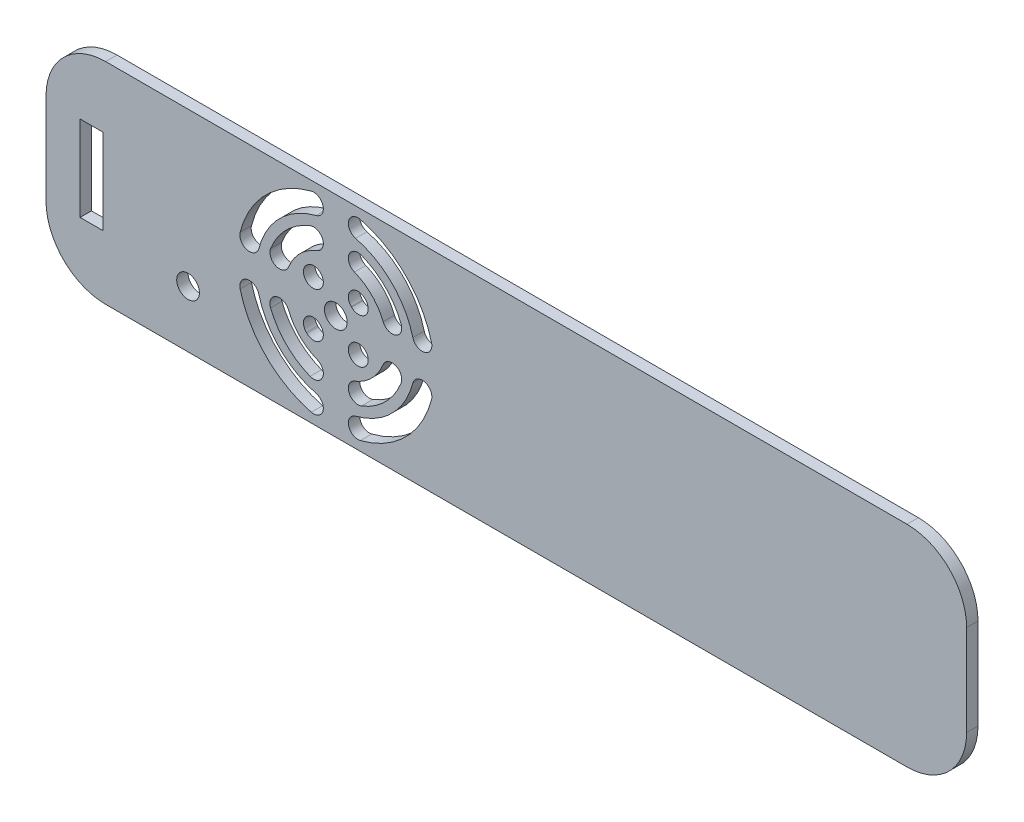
ISO-10303-21;
HEADER;
FILE_DESCRIPTION(('STEP AP214'),'2;1');
FILE_NAME('part.step','',(''),(''),'','','');
FILE_SCHEMA(('AUTOMOTIVE_DESIGN { 1 0 10303 214 1 1 1 1 }'));
ENDSEC;
DATA;
#1=APPLICATION_CONTEXT('core data for automotive mechanical design processes');
#2=APPLICATION_PROTOCOL_DEFINITION('international standard','automotive_design',2000,#1);
#3=PRODUCT_CONTEXT('',#1,'mechanical');
#4=PRODUCT('Part','Part','',(#3));
#5=PRODUCT_RELATED_PRODUCT_CATEGORY('part','',(#4));
#6=PRODUCT_DEFINITION_FORMATION('','',#4);
#7=PRODUCT_DEFINITION_CONTEXT('part definition',#1,'design');
#8=PRODUCT_DEFINITION('design','',#6,#7);
#9=PRODUCT_DEFINITION_SHAPE('','',#8);
#10=(LENGTH_UNIT() NAMED_UNIT(*) SI_UNIT(.MILLI.,.METRE.));
#11=(NAMED_UNIT(*) PLANE_ANGLE_UNIT() SI_UNIT($,.RADIAN.));
#12=(NAMED_UNIT(*) SI_UNIT($,.STERADIAN.) SOLID_ANGLE_UNIT());
#13=UNCERTAINTY_MEASURE_WITH_UNIT(LENGTH_MEASURE(1.E-05),#10,'distance_accuracy_value','');
#14=(GEOMETRIC_REPRESENTATION_CONTEXT(3) GLOBAL_UNCERTAINTY_ASSIGNED_CONTEXT((#13)) GLOBAL_UNIT_ASSIGNED_CONTEXT((#10,
#11,#12)) REPRESENTATION_CONTEXT('',''));
#15=CARTESIAN_POINT('',(0.,0.,0.));
#16=DIRECTION('',(0.,0.,1.));
#17=DIRECTION('',(1.,0.,0.));
#18=AXIS2_PLACEMENT_3D('',#15,#16,#17);
#19=CARTESIAN_POINT('',(70.5,-8.,2.));
#20=DIRECTION('',(0.,0.,-1.));
#21=DIRECTION('',(-1.,0.,0.));
#22=AXIS2_PLACEMENT_3D('',#19,#20,#21);
#23=CYLINDRICAL_SURFACE('',#22,10.5);
#24=CARTESIAN_POINT('',(70.5,-8.,0.));
#25=DIRECTION('',(0.,0.,1.));
#26=DIRECTION('',(1.,0.,0.));
#27=AXIS2_PLACEMENT_3D('',#24,#25,#26);
#28=CIRCLE('',#27,10.5);
#29=CARTESIAN_POINT('',(70.5,-18.5,0.));
#30=VERTEX_POINT('',#29);
#31=CARTESIAN_POINT('',(81.,-8.,0.));
#32=VERTEX_POINT('',#31);
#33=EDGE_CURVE('E636',#30,#32,#28,.T.);
#34=ORIENTED_EDGE('',*,*,#33,.T.);
#35=DIRECTION('',(0.,0.,-1.));
#36=VECTOR('',#35,1.);
#37=CARTESIAN_POINT('',(81.,-8.,2.));
#38=LINE('',#37,#36);
#39=CARTESIAN_POINT('',(81.,-8.,2.));
#40=VERTEX_POINT('',#39);
#41=EDGE_CURVE('E12',#40,#32,#38,.T.);
#42=ORIENTED_EDGE('',*,*,#41,.F.);
#43=CARTESIAN_POINT('',(70.5,-8.,2.));
#44=DIRECTION('',(0.,0.,1.));
#45=DIRECTION('',(1.,0.,0.));
#46=AXIS2_PLACEMENT_3D('',#43,#44,#45);
#47=CIRCLE('',#46,10.5);
#48=CARTESIAN_POINT('',(70.5,-18.5,2.));
#49=VERTEX_POINT('',#48);
#50=EDGE_CURVE('E665',#49,#40,#47,.T.);
#51=ORIENTED_EDGE('',*,*,#50,.F.);
#52=DIRECTION('',(0.,0.,-1.));
#53=VECTOR('',#52,1.);
#54=CARTESIAN_POINT('',(70.5,-18.5,2.));
#55=LINE('',#54,#53);
#56=EDGE_CURVE('E639',#49,#30,#55,.T.);
#57=ORIENTED_EDGE('',*,*,#56,.T.);
#58=EDGE_LOOP('',(#34,#42,#51,#57));
#59=FACE_BOUND('',#58,.T.);
#60=ADVANCED_FACE('F42',(#59),#23,.T.);
#61=CARTESIAN_POINT('',(81.,8.,2.));
#62=DIRECTION('',(-1.,0.,0.));
#63=DIRECTION('',(0.,0.,1.));
#64=AXIS2_PLACEMENT_3D('',#61,#62,#63);
#65=PLANE('',#64);
#66=DIRECTION('',(0.,1.,0.));
#67=VECTOR('',#66,1.);
#68=CARTESIAN_POINT('',(81.,8.,0.));
#69=LINE('',#68,#67);
#70=CARTESIAN_POINT('',(81.,8.,0.));
#71=VERTEX_POINT('',#70);
#72=EDGE_CURVE('E642',#32,#71,#69,.T.);
#73=ORIENTED_EDGE('',*,*,#72,.T.);
#74=DIRECTION('',(0.,0.,-1.));
#75=VECTOR('',#74,1.);
#76=CARTESIAN_POINT('',(81.,8.,2.));
#77=LINE('',#76,#75);
#78=CARTESIAN_POINT('',(81.,8.,2.));
#79=VERTEX_POINT('',#78);
#80=EDGE_CURVE('E49',#79,#71,#77,.T.);
#81=ORIENTED_EDGE('',*,*,#80,.F.);
#82=DIRECTION('',(0.,1.,0.));
#83=VECTOR('',#82,1.);
#84=CARTESIAN_POINT('',(81.,8.,2.));
#85=LINE('',#84,#83);
#86=EDGE_CURVE('E715',#40,#79,#85,.T.);
#87=ORIENTED_EDGE('',*,*,#86,.F.);
#88=ORIENTED_EDGE('',*,*,#41,.T.);
#89=EDGE_LOOP('',(#73,#81,#87,#88));
#90=FACE_BOUND('',#89,.T.);
#91=ADVANCED_FACE('F625',(#90),#65,.F.);
#92=CARTESIAN_POINT('',(70.5,8.,2.));
#93=DIRECTION('',(0.,0.,-1.));
#94=DIRECTION('',(-1.,0.,0.));
#95=AXIS2_PLACEMENT_3D('',#92,#93,#94);
#96=CYLINDRICAL_SURFACE('',#95,10.5);
#97=CARTESIAN_POINT('',(70.5,8.,0.));
#98=DIRECTION('',(0.,0.,1.));
#99=DIRECTION('',(1.,0.,0.));
#100=AXIS2_PLACEMENT_3D('',#97,#98,#99);
#101=CIRCLE('',#100,10.5);
#102=CARTESIAN_POINT('',(70.5,18.5,0.));
#103=VERTEX_POINT('',#102);
#104=EDGE_CURVE('E645',#71,#103,#101,.T.);
#105=ORIENTED_EDGE('',*,*,#104,.T.);
#106=DIRECTION('',(0.,0.,-1.));
#107=VECTOR('',#106,1.);
#108=CARTESIAN_POINT('',(70.5,18.5,2.));
#109=LINE('',#108,#107);
#110=CARTESIAN_POINT('',(70.5,18.5,2.));
#111=VERTEX_POINT('',#110);
#112=EDGE_CURVE('E679',#111,#103,#109,.T.);
#113=ORIENTED_EDGE('',*,*,#112,.F.);
#114=CARTESIAN_POINT('',(70.5,8.,2.));
#115=DIRECTION('',(0.,0.,1.));
#116=DIRECTION('',(1.,0.,0.));
#117=AXIS2_PLACEMENT_3D('',#114,#115,#116);
#118=CIRCLE('',#117,10.5);
#119=EDGE_CURVE('E687',#79,#111,#118,.T.);
#120=ORIENTED_EDGE('',*,*,#119,.F.);
#121=ORIENTED_EDGE('',*,*,#80,.T.);
#122=EDGE_LOOP('',(#105,#113,#120,#121));
#123=FACE_BOUND('',#122,.T.);
#124=ADVANCED_FACE('F630',(#123),#96,.T.);
#125=CARTESIAN_POINT('',(-70.5,18.5,2.));
#126=DIRECTION('',(0.,-1.,0.));
#127=DIRECTION('',(0.,0.,-1.));
#128=AXIS2_PLACEMENT_3D('',#125,#126,#127);
#129=PLANE('',#128);
#130=DIRECTION('',(-1.,0.,0.));
#131=VECTOR('',#130,1.);
#132=CARTESIAN_POINT('',(-70.5,18.5,0.));
#133=LINE('',#132,#131);
#134=CARTESIAN_POINT('',(-70.5,18.5,0.));
#135=VERTEX_POINT('',#134);
#136=EDGE_CURVE('E653',#103,#135,#133,.T.);
#137=ORIENTED_EDGE('',*,*,#136,.T.);
#138=DIRECTION('',(0.,0.,-1.));
#139=VECTOR('',#138,1.);
#140=CARTESIAN_POINT('',(-70.5,18.5,2.));
#141=LINE('',#140,#139);
#142=CARTESIAN_POINT('',(-70.5,18.5,2.));
#143=VERTEX_POINT('',#142);
#144=EDGE_CURVE('E676',#143,#135,#141,.T.);
#145=ORIENTED_EDGE('',*,*,#144,.F.);
#146=DIRECTION('',(-1.,0.,0.));
#147=VECTOR('',#146,1.);
#148=CARTESIAN_POINT('',(-70.5,18.5,2.));
#149=LINE('',#148,#147);
#150=EDGE_CURVE('E703',#111,#143,#149,.T.);
#151=ORIENTED_EDGE('',*,*,#150,.F.);
#152=ORIENTED_EDGE('',*,*,#112,.T.);
#153=EDGE_LOOP('',(#137,#145,#151,#152));
#154=FACE_BOUND('',#153,.T.);
#155=ADVANCED_FACE('F693',(#154),#129,.F.);
#156=CARTESIAN_POINT('',(-70.5,8.,2.));
#157=DIRECTION('',(0.,0.,-1.));
#158=DIRECTION('',(-1.,0.,0.));
#159=AXIS2_PLACEMENT_3D('',#156,#157,#158);
#160=CYLINDRICAL_SURFACE('',#159,10.5);
#161=CARTESIAN_POINT('',(-70.5,8.,0.));
#162=DIRECTION('',(0.,0.,1.));
#163=DIRECTION('',(1.,0.,0.));
#164=AXIS2_PLACEMENT_3D('',#161,#162,#163);
#165=CIRCLE('',#164,10.5);
#166=CARTESIAN_POINT('',(-81.,8.,0.));
#167=VERTEX_POINT('',#166);
#168=EDGE_CURVE('E657',#135,#167,#165,.T.);
#169=ORIENTED_EDGE('',*,*,#168,.T.);
#170=DIRECTION('',(0.,0.,-1.));
#171=VECTOR('',#170,1.);
#172=CARTESIAN_POINT('',(-81.,8.,2.));
#173=LINE('',#172,#171);
#174=CARTESIAN_POINT('',(-81.,8.,2.));
#175=VERTEX_POINT('',#174);
#176=EDGE_CURVE('E673',#175,#167,#173,.T.);
#177=ORIENTED_EDGE('',*,*,#176,.F.);
#178=CARTESIAN_POINT('',(-70.5,8.,2.));
#179=DIRECTION('',(0.,0.,1.));
#180=DIRECTION('',(1.,0.,0.));
#181=AXIS2_PLACEMENT_3D('',#178,#179,#180);
#182=CIRCLE('',#181,10.5);
#183=EDGE_CURVE('E699',#143,#175,#182,.T.);
#184=ORIENTED_EDGE('',*,*,#183,.F.);
#185=ORIENTED_EDGE('',*,*,#144,.T.);
#186=EDGE_LOOP('',(#169,#177,#184,#185));
#187=FACE_BOUND('',#186,.T.);
#188=ADVANCED_FACE('F697',(#187),#160,.T.);
#189=CARTESIAN_POINT('',(-81.,8.,2.));
#190=DIRECTION('',(1.,0.,0.));
#191=DIRECTION('',(0.,0.,-1.));
#192=AXIS2_PLACEMENT_3D('',#189,#190,#191);
#193=PLANE('',#192);
#194=DIRECTION('',(0.,-1.,0.));
#195=VECTOR('',#194,1.);
#196=CARTESIAN_POINT('',(-81.,8.,0.));
#197=LINE('',#196,#195);
#198=CARTESIAN_POINT('',(-81.,-8.,0.));
#199=VERTEX_POINT('',#198);
#200=EDGE_CURVE('E659',#167,#199,#197,.T.);
#201=ORIENTED_EDGE('',*,*,#200,.T.);
#202=DIRECTION('',(0.,0.,-1.));
#203=VECTOR('',#202,1.);
#204=CARTESIAN_POINT('',(-81.,-8.,2.));
#205=LINE('',#204,#203);
#206=CARTESIAN_POINT('',(-81.,-8.,2.));
#207=VERTEX_POINT('',#206);
#208=EDGE_CURVE('E670',#207,#199,#205,.T.);
#209=ORIENTED_EDGE('',*,*,#208,.F.);
#210=DIRECTION('',(0.,-1.,0.));
#211=VECTOR('',#210,1.);
#212=CARTESIAN_POINT('',(-81.,8.,2.));
#213=LINE('',#212,#211);
#214=EDGE_CURVE('E702',#175,#207,#213,.T.);
#215=ORIENTED_EDGE('',*,*,#214,.F.);
#216=ORIENTED_EDGE('',*,*,#176,.T.);
#217=EDGE_LOOP('',(#201,#209,#215,#216));
#218=FACE_BOUND('',#217,.T.);
#219=ADVANCED_FACE('F1014',(#218),#193,.F.);
#220=CARTESIAN_POINT('',(-70.5,-8.,2.));
#221=DIRECTION('',(0.,0.,-1.));
#222=DIRECTION('',(-1.,0.,0.));
#223=AXIS2_PLACEMENT_3D('',#220,#221,#222);
#224=CYLINDRICAL_SURFACE('',#223,10.5);
#225=CARTESIAN_POINT('',(-70.5,-8.,0.));
#226=DIRECTION('',(0.,0.,1.));
#227=DIRECTION('',(1.,0.,0.));
#228=AXIS2_PLACEMENT_3D('',#225,#226,#227);
#229=CIRCLE('',#228,10.5);
#230=CARTESIAN_POINT('',(-70.5,-18.5,0.));
#231=VERTEX_POINT('',#230);
#232=EDGE_CURVE('E661',#199,#231,#229,.T.);
#233=ORIENTED_EDGE('',*,*,#232,.T.);
#234=DIRECTION('',(0.,0.,-1.));
#235=VECTOR('',#234,1.);
#236=CARTESIAN_POINT('',(-70.5,-18.5,2.));
#237=LINE('',#236,#235);
#238=CARTESIAN_POINT('',(-70.5,-18.5,2.));
#239=VERTEX_POINT('',#238);
#240=EDGE_CURVE('E667',#239,#231,#237,.T.);
#241=ORIENTED_EDGE('',*,*,#240,.F.);
#242=CARTESIAN_POINT('',(-70.5,-8.,2.));
#243=DIRECTION('',(0.,0.,1.));
#244=DIRECTION('',(1.,0.,0.));
#245=AXIS2_PLACEMENT_3D('',#242,#243,#244);
#246=CIRCLE('',#245,10.5);
#247=EDGE_CURVE('E705',#207,#239,#246,.T.);
#248=ORIENTED_EDGE('',*,*,#247,.F.);
#249=ORIENTED_EDGE('',*,*,#208,.T.);
#250=EDGE_LOOP('',(#233,#241,#248,#249));
#251=FACE_BOUND('',#250,.T.);
#252=ADVANCED_FACE('F1011',(#251),#224,.T.);
#253=CARTESIAN_POINT('',(-70.5,-18.5,2.));
#254=DIRECTION('',(0.,1.,0.));
#255=DIRECTION('',(0.,0.,1.));
#256=AXIS2_PLACEMENT_3D('',#253,#254,#255);
#257=PLANE('',#256);
#258=DIRECTION('',(1.,0.,0.));
#259=VECTOR('',#258,1.);
#260=CARTESIAN_POINT('',(-70.5,-18.5,0.));
#261=LINE('',#260,#259);
#262=EDGE_CURVE('E663',#231,#30,#261,.T.);
#263=ORIENTED_EDGE('',*,*,#262,.T.);
#264=ORIENTED_EDGE('',*,*,#56,.F.);
#265=DIRECTION('',(1.,0.,0.));
#266=VECTOR('',#265,1.);
#267=CARTESIAN_POINT('',(-70.5,-18.5,2.));
#268=LINE('',#267,#266);
#269=EDGE_CURVE('E650',#239,#49,#268,.T.);
#270=ORIENTED_EDGE('',*,*,#269,.F.);
#271=ORIENTED_EDGE('',*,*,#240,.T.);
#272=EDGE_LOOP('',(#263,#264,#270,#271));
#273=FACE_BOUND('',#272,.T.);
#274=ADVANCED_FACE('F714',(#273),#257,.F.);
#275=CARTESIAN_POINT('',(70.5,-8.,2.));
#276=DIRECTION('',(0.,0.,1.));
#277=DIRECTION('',(1.,0.,0.));
#278=AXIS2_PLACEMENT_3D('',#275,#276,#277);
#279=PLANE('',#278);
#280=CARTESIAN_POINT('',(-56.,-8.5,2.));
#281=DIRECTION('',(0.,0.,1.));
#282=DIRECTION('',(1.,0.,0.));
#283=AXIS2_PLACEMENT_3D('',#280,#281,#282);
#284=CIRCLE('',#283,2.);
#285=CARTESIAN_POINT('',(-54.,-8.5,2.));
#286=VERTEX_POINT('',#285);
#287=EDGE_CURVE('E449',#286,#286,#284,.T.);
#288=ORIENTED_EDGE('',*,*,#287,.F.);
#289=EDGE_LOOP('',(#288));
#290=FACE_BOUND('',#289,.T.);
#291=CARTESIAN_POINT('',(-45.1977229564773,-3.9,2.));
#292=DIRECTION('',(0.,0.,1.));
#293=DIRECTION('',(-1.,0.,0.));
#294=AXIS2_PLACEMENT_3D('',#291,#292,#293);
#295=CIRCLE('',#294,1.69999999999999);
#296=CARTESIAN_POINT('',(-43.5510764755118,-3.47744187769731,2.));
#297=VERTEX_POINT('',#296);
#298=CARTESIAN_POINT('',(-46.8443694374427,-4.32255812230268,2.));
#299=VERTEX_POINT('',#298);
#300=EDGE_CURVE('E56',#297,#299,#295,.T.);
#301=ORIENTED_EDGE('',*,*,#300,.F.);
#302=CARTESIAN_POINT('',(-30.,0.,2.));
#303=DIRECTION('',(0.,0.,-1.));
#304=DIRECTION('',(1.,0.,0.));
#305=AXIS2_PLACEMENT_3D('',#302,#303,#304);
#306=CIRCLE('',#305,13.9901492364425);
#307=CARTESIAN_POINT('',(-33.4774418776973,-13.5510764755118,2.));
#308=VERTEX_POINT('',#307);
#309=EDGE_CURVE('E526',#308,#297,#306,.T.);
#310=ORIENTED_EDGE('',*,*,#309,.F.);
#311=CARTESIAN_POINT('',(-33.9,-15.1977229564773,2.));
#312=DIRECTION('',(0.,0.,1.));
#313=DIRECTION('',(1.,0.,0.));
#314=AXIS2_PLACEMENT_3D('',#311,#312,#313);
#315=CIRCLE('',#314,1.7);
#316=CARTESIAN_POINT('',(-34.3225581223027,-16.8443694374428,2.));
#317=VERTEX_POINT('',#316);
#318=EDGE_CURVE('E523',#317,#308,#315,.T.);
#319=ORIENTED_EDGE('',*,*,#318,.F.);
#320=CARTESIAN_POINT('',(-30.,0.,2.));
#321=DIRECTION('',(0.,0.,1.));
#322=DIRECTION('',(1.,0.,0.));
#323=AXIS2_PLACEMENT_3D('',#320,#321,#322);
#324=CIRCLE('',#323,17.3901492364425);
#325=EDGE_CURVE('E519',#299,#317,#324,.T.);
#326=ORIENTED_EDGE('',*,*,#325,.F.);
#327=EDGE_LOOP('',(#301,#310,#319,#326));
#328=FACE_BOUND('',#327,.T.);
#329=CARTESIAN_POINT('',(-39.8977229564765,-3.9,2.));
#330=DIRECTION('',(0.,0.,1.));
#331=DIRECTION('',(-1.,0.,0.));
#332=AXIS2_PLACEMENT_3D('',#329,#330,#331);
#333=CIRCLE('',#332,1.70000000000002);
#334=CARTESIAN_POINT('',(-38.3160775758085,-3.27678423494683,2.));
#335=VERTEX_POINT('',#334);
#336=CARTESIAN_POINT('',(-41.4793683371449,-4.52321576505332,2.));
#337=VERTEX_POINT('',#336);
#338=EDGE_CURVE('E64',#335,#337,#333,.T.);
#339=ORIENTED_EDGE('',*,*,#338,.F.);
#340=CARTESIAN_POINT('',(-30.,0.,2.));
#341=DIRECTION('',(0.,0.,-1.));
#342=DIRECTION('',(1.,0.,0.));
#343=AXIS2_PLACEMENT_3D('',#340,#341,#342);
#344=CIRCLE('',#343,8.9383701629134);
#345=CARTESIAN_POINT('',(-33.276784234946,-8.31607757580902,2.));
#346=VERTEX_POINT('',#345);
#347=EDGE_CURVE('E855',#346,#335,#344,.T.);
#348=ORIENTED_EDGE('',*,*,#347,.F.);
#349=CARTESIAN_POINT('',(-33.8999999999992,-9.89772295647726,2.));
#350=DIRECTION('',(0.,0.,1.));
#351=DIRECTION('',(1.,0.,0.));
#352=AXIS2_PLACEMENT_3D('',#349,#350,#351);
#353=CIRCLE('',#352,1.70000000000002);
#354=CARTESIAN_POINT('',(-34.5232157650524,-11.4793683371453,2.));
#355=VERTEX_POINT('',#354);
#356=EDGE_CURVE('E871',#355,#346,#353,.T.);
#357=ORIENTED_EDGE('',*,*,#356,.F.);
#358=CARTESIAN_POINT('',(-30.,0.,2.));
#359=DIRECTION('',(0.,0.,1.));
#360=DIRECTION('',(1.,0.,0.));
#361=AXIS2_PLACEMENT_3D('',#358,#359,#360);
#362=CIRCLE('',#361,12.3383701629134);
#363=EDGE_CURVE('E867',#337,#355,#362,.T.);
#364=ORIENTED_EDGE('',*,*,#363,.F.);
#365=EDGE_LOOP('',(#339,#348,#357,#364));
#366=FACE_BOUND('',#365,.T.);
#367=CARTESIAN_POINT('',(-26.0999999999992,-9.89772295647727,2.));
#368=DIRECTION('',(0.,0.,1.));
#369=DIRECTION('',(-1.,0.,0.));
#370=AXIS2_PLACEMENT_3D('',#367,#368,#369);
#371=CIRCLE('',#370,1.70000000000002);
#372=CARTESIAN_POINT('',(-26.7232157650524,-8.31607757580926,2.));
#373=VERTEX_POINT('',#372);
#374=CARTESIAN_POINT('',(-25.4767842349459,-11.4793683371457,2.));
#375=VERTEX_POINT('',#374);
#376=EDGE_CURVE('E812',#373,#375,#371,.T.);
#377=ORIENTED_EDGE('',*,*,#376,.F.);
#378=CARTESIAN_POINT('',(-30.,0.,2.));
#379=DIRECTION('',(0.,0.,-1.));
#380=DIRECTION('',(1.,0.,0.));
#381=AXIS2_PLACEMENT_3D('',#378,#379,#380);
#382=CIRCLE('',#381,8.93837016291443);
#383=CARTESIAN_POINT('',(-21.6839224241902,-3.27678423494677,2.));
#384=VERTEX_POINT('',#383);
#385=EDGE_CURVE('E823',#384,#373,#382,.T.);
#386=ORIENTED_EDGE('',*,*,#385,.F.);
#387=CARTESIAN_POINT('',(-20.102277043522,-3.90000000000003,2.));
#388=DIRECTION('',(0.,0.,1.));
#389=DIRECTION('',(1.,0.,0.));
#390=AXIS2_PLACEMENT_3D('',#387,#388,#389);
#391=CIRCLE('',#390,1.70000000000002);
#392=CARTESIAN_POINT('',(-18.5206316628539,-4.52321576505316,2.));
#393=VERTEX_POINT('',#392);
#394=EDGE_CURVE('E838',#393,#384,#391,.T.);
#395=ORIENTED_EDGE('',*,*,#394,.F.);
#396=CARTESIAN_POINT('',(-30.,0.,2.));
#397=DIRECTION('',(0.,0.,1.));
#398=DIRECTION('',(1.,0.,0.));
#399=AXIS2_PLACEMENT_3D('',#396,#397,#398);
#400=CIRCLE('',#399,12.3383701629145);
#401=EDGE_CURVE('E835',#375,#393,#400,.T.);
#402=ORIENTED_EDGE('',*,*,#401,.F.);
#403=EDGE_LOOP('',(#377,#386,#395,#402));
#404=FACE_BOUND('',#403,.T.);
#405=CARTESIAN_POINT('',(-26.0999999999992,-4.00000000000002,2.));
#406=DIRECTION('',(0.,0.,1.));
#407=DIRECTION('',(-1.,0.,0.));
#408=AXIS2_PLACEMENT_3D('',#405,#406,#407);
#409=CIRCLE('',#408,1.70000000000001);
#410=CARTESIAN_POINT('',(-27.2867702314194,-2.78279976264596,2.));
#411=VERTEX_POINT('',#410);
#412=CARTESIAN_POINT('',(-24.913229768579,-5.2172002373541,2.));
#413=VERTEX_POINT('',#412);
#414=EDGE_CURVE('E531',#411,#413,#409,.T.);
#415=ORIENTED_EDGE('',*,*,#414,.F.);
#416=CARTESIAN_POINT('',(-30.,0.,2.));
#417=DIRECTION('',(0.,0.,-1.));
#418=DIRECTION('',(1.,0.,0.));
#419=AXIS2_PLACEMENT_3D('',#416,#417,#418);
#420=CIRCLE('',#419,3.88659108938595);
#421=CARTESIAN_POINT('',(-27.2172002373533,-2.7132297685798,2.));
#422=VERTEX_POINT('',#421);
#423=EDGE_CURVE('E791',#422,#411,#420,.T.);
#424=ORIENTED_EDGE('',*,*,#423,.F.);
#425=CARTESIAN_POINT('',(-25.9999999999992,-3.90000000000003,2.));
#426=DIRECTION('',(0.,0.,1.));
#427=DIRECTION('',(1.,0.,0.));
#428=AXIS2_PLACEMENT_3D('',#425,#426,#427);
#429=CIRCLE('',#428,1.70000000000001);
#430=CARTESIAN_POINT('',(-24.7827997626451,-5.08677023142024,2.));
#431=VERTEX_POINT('',#430);
#432=EDGE_CURVE('E805',#431,#422,#429,.T.);
#433=ORIENTED_EDGE('',*,*,#432,.F.);
#434=CARTESIAN_POINT('',(-30.,0.,2.));
#435=DIRECTION('',(0.,0.,1.));
#436=DIRECTION('',(1.,0.,0.));
#437=AXIS2_PLACEMENT_3D('',#434,#435,#436);
#438=CIRCLE('',#437,7.28659108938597);
#439=EDGE_CURVE('E802',#413,#431,#438,.T.);
#440=ORIENTED_EDGE('',*,*,#439,.F.);
#441=EDGE_LOOP('',(#415,#424,#433,#440));
#442=FACE_BOUND('',#441,.T.);
#443=CARTESIAN_POINT('',(-26.1,-15.1977229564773,2.));
#444=DIRECTION('',(0.,0.,1.));
#445=DIRECTION('',(-1.,0.,0.));
#446=AXIS2_PLACEMENT_3D('',#443,#444,#445);
#447=CIRCLE('',#446,1.7);
#448=CARTESIAN_POINT('',(-26.5225581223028,-13.5510764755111,2.));
#449=VERTEX_POINT('',#448);
#450=CARTESIAN_POINT('',(-25.6774418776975,-16.8443694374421,2.));
#451=VERTEX_POINT('',#450);
#452=EDGE_CURVE('E494',#449,#451,#447,.T.);
#453=ORIENTED_EDGE('',*,*,#452,.F.);
#454=CARTESIAN_POINT('',(-30.,0.,2.));
#455=DIRECTION('',(0.,0.,-1.));
#456=DIRECTION('',(1.,0.,0.));
#457=AXIS2_PLACEMENT_3D('',#454,#455,#456);
#458=CIRCLE('',#457,13.9901492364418);
#459=CARTESIAN_POINT('',(-16.4489235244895,-3.47744187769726,2.));
#460=VERTEX_POINT('',#459);
#461=EDGE_CURVE('E482',#460,#449,#458,.T.);
#462=ORIENTED_EDGE('',*,*,#461,.F.);
#463=CARTESIAN_POINT('',(-14.8022770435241,-3.9,2.));
#464=DIRECTION('',(0.,0.,1.));
#465=DIRECTION('',(1.,0.,0.));
#466=AXIS2_PLACEMENT_3D('',#463,#464,#465);
#467=CIRCLE('',#466,1.7);
#468=CARTESIAN_POINT('',(-13.155630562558,-4.3225581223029,2.));
#469=VERTEX_POINT('',#468);
#470=EDGE_CURVE('E1549',#469,#460,#467,.T.);
#471=ORIENTED_EDGE('',*,*,#470,.F.);
#472=CARTESIAN_POINT('',(-30.,0.,2.));
#473=DIRECTION('',(0.,0.,1.));
#474=DIRECTION('',(1.,0.,0.));
#475=AXIS2_PLACEMENT_3D('',#472,#473,#474);
#476=CIRCLE('',#475,17.3901492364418);
#477=EDGE_CURVE('E1551',#451,#469,#476,.T.);
#478=ORIENTED_EDGE('',*,*,#477,.F.);
#479=EDGE_LOOP('',(#453,#462,#471,#478));
#480=FACE_BOUND('',#479,.T.);
#481=CARTESIAN_POINT('',(-30.,0.,2.));
#482=DIRECTION('',(0.,0.,1.));
#483=DIRECTION('',(1.,0.,0.));
#484=AXIS2_PLACEMENT_3D('',#481,#482,#483);
#485=CIRCLE('',#484,2.);
#486=CARTESIAN_POINT('',(-28.,0.,2.));
#487=VERTEX_POINT('',#486);
#488=EDGE_CURVE('E472',#487,#487,#485,.T.);
#489=ORIENTED_EDGE('',*,*,#488,.F.);
#490=EDGE_LOOP('',(#489));
#491=FACE_BOUND('',#490,.T.);
#492=CARTESIAN_POINT('',(-20.1022770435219,3.9,2.));
#493=DIRECTION('',(0.,0.,1.));
#494=DIRECTION('',(-1.,0.,0.));
#495=AXIS2_PLACEMENT_3D('',#492,#493,#494);
#496=CIRCLE('',#495,1.70000000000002);
#497=CARTESIAN_POINT('',(-21.6839224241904,3.27678423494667,2.));
#498=VERTEX_POINT('',#497);
#499=CARTESIAN_POINT('',(-18.5206316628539,4.52321576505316,2.));
#500=VERTEX_POINT('',#499);
#501=EDGE_CURVE('E571',#498,#500,#496,.T.);
#502=ORIENTED_EDGE('',*,*,#501,.F.);
#503=CARTESIAN_POINT('',(-30.,0.,2.));
#504=DIRECTION('',(0.,0.,-1.));
#505=DIRECTION('',(1.,0.,0.));
#506=AXIS2_PLACEMENT_3D('',#503,#504,#505);
#507=CIRCLE('',#506,8.93837016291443);
#508=CARTESIAN_POINT('',(-26.7232157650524,8.31607757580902,2.));
#509=VERTEX_POINT('',#508);
#510=EDGE_CURVE('E580',#509,#498,#507,.T.);
#511=ORIENTED_EDGE('',*,*,#510,.F.);
#512=CARTESIAN_POINT('',(-26.0999999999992,9.89772295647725,2.));
#513=DIRECTION('',(0.,0.,1.));
#514=DIRECTION('',(1.,0.,0.));
#515=AXIS2_PLACEMENT_3D('',#512,#513,#514);
#516=CIRCLE('',#515,1.70000000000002);
#517=CARTESIAN_POINT('',(-25.4767842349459,11.4793683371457,2.));
#518=VERTEX_POINT('',#517);
#519=EDGE_CURVE('E577',#518,#509,#516,.T.);
#520=ORIENTED_EDGE('',*,*,#519,.F.);
#521=CARTESIAN_POINT('',(-30.,0.,2.));
#522=DIRECTION('',(0.,0.,1.));
#523=DIRECTION('',(1.,0.,0.));
#524=AXIS2_PLACEMENT_3D('',#521,#522,#523);
#525=CIRCLE('',#524,12.3383701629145);
#526=EDGE_CURVE('E573',#500,#518,#525,.T.);
#527=ORIENTED_EDGE('',*,*,#526,.F.);
#528=EDGE_LOOP('',(#502,#511,#520,#527));
#529=FACE_BOUND('',#528,.T.);
#530=CARTESIAN_POINT('',(-25.9999999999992,3.90000000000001,2.));
#531=DIRECTION('',(0.,0.,1.));
#532=DIRECTION('',(-1.,0.,0.));
#533=AXIS2_PLACEMENT_3D('',#530,#531,#532);
#534=CIRCLE('',#533,1.70000000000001);
#535=CARTESIAN_POINT('',(-27.2172002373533,2.71322976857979,2.));
#536=VERTEX_POINT('',#535);
#537=CARTESIAN_POINT('',(-24.7827997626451,5.08677023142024,2.));
#538=VERTEX_POINT('',#537);
#539=EDGE_CURVE('E471',#536,#538,#534,.T.);
#540=ORIENTED_EDGE('',*,*,#539,.F.);
#541=CARTESIAN_POINT('',(-30.,0.,2.));
#542=DIRECTION('',(0.,0.,-1.));
#543=DIRECTION('',(1.,0.,0.));
#544=AXIS2_PLACEMENT_3D('',#541,#542,#543);
#545=CIRCLE('',#544,3.88659108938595);
#546=CARTESIAN_POINT('',(-27.2867702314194,2.78279976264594,2.));
#547=VERTEX_POINT('',#546);
#548=EDGE_CURVE('E541',#547,#536,#545,.T.);
#549=ORIENTED_EDGE('',*,*,#548,.F.);
#550=CARTESIAN_POINT('',(-26.0999999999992,4.00000000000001,2.));
#551=DIRECTION('',(0.,0.,1.));
#552=DIRECTION('',(1.,0.,0.));
#553=AXIS2_PLACEMENT_3D('',#550,#551,#552);
#554=CIRCLE('',#553,1.70000000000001);
#555=CARTESIAN_POINT('',(-24.913229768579,5.2172002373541,2.));
#556=VERTEX_POINT('',#555);
#557=EDGE_CURVE('E1722',#556,#547,#554,.T.);
#558=ORIENTED_EDGE('',*,*,#557,.F.);
#559=CARTESIAN_POINT('',(-30.,0.,2.));
#560=DIRECTION('',(0.,0.,1.));
#561=DIRECTION('',(1.,0.,0.));
#562=AXIS2_PLACEMENT_3D('',#559,#560,#561);
#563=CIRCLE('',#562,7.28659108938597);
#564=EDGE_CURVE('E1716',#538,#556,#563,.T.);
#565=ORIENTED_EDGE('',*,*,#564,.F.);
#566=EDGE_LOOP('',(#540,#549,#558,#565));
#567=FACE_BOUND('',#566,.T.);
#568=CARTESIAN_POINT('',(-33.8999999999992,9.89772295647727,2.));
#569=DIRECTION('',(0.,0.,1.));
#570=DIRECTION('',(-1.,0.,0.));
#571=AXIS2_PLACEMENT_3D('',#568,#569,#570);
#572=CIRCLE('',#571,1.70000000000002);
#573=CARTESIAN_POINT('',(-33.2767842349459,8.31607757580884,2.));
#574=VERTEX_POINT('',#573);
#575=CARTESIAN_POINT('',(-34.5232157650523,11.4793683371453,2.));
#576=VERTEX_POINT('',#575);
#577=EDGE_CURVE('E1424',#574,#576,#572,.T.);
#578=ORIENTED_EDGE('',*,*,#577,.F.);
#579=CARTESIAN_POINT('',(-30.,0.,2.));
#580=DIRECTION('',(0.,0.,-1.));
#581=DIRECTION('',(1.,0.,0.));
#582=AXIS2_PLACEMENT_3D('',#579,#580,#581);
#583=CIRCLE('',#582,8.9383701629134);
#584=CARTESIAN_POINT('',(-38.3160775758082,3.27678423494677,2.));
#585=VERTEX_POINT('',#584);
#586=EDGE_CURVE('E1431',#585,#574,#583,.T.);
#587=ORIENTED_EDGE('',*,*,#586,.F.);
#588=CARTESIAN_POINT('',(-39.8977229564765,3.90000000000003,2.));
#589=DIRECTION('',(0.,0.,1.));
#590=DIRECTION('',(1.,0.,0.));
#591=AXIS2_PLACEMENT_3D('',#588,#589,#590);
#592=CIRCLE('',#591,1.70000000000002);
#593=CARTESIAN_POINT('',(-41.4793683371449,4.52321576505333,2.));
#594=VERTEX_POINT('',#593);
#595=EDGE_CURVE('E1447',#594,#585,#592,.T.);
#596=ORIENTED_EDGE('',*,*,#595,.F.);
#597=CARTESIAN_POINT('',(-30.,0.,2.));
#598=DIRECTION('',(0.,0.,1.));
#599=DIRECTION('',(1.,0.,0.));
#600=AXIS2_PLACEMENT_3D('',#597,#598,#599);
#601=CIRCLE('',#600,12.3383701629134);
#602=EDGE_CURVE('E1444',#576,#594,#601,.T.);
#603=ORIENTED_EDGE('',*,*,#602,.F.);
#604=EDGE_LOOP('',(#578,#587,#596,#603));
#605=FACE_BOUND('',#604,.T.);
#606=CARTESIAN_POINT('',(-33.8999999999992,4.00000000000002,2.));
#607=DIRECTION('',(0.,0.,1.));
#608=DIRECTION('',(-1.,0.,0.));
#609=AXIS2_PLACEMENT_3D('',#606,#607,#608);
#610=CIRCLE('',#609,1.70000000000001);
#611=CARTESIAN_POINT('',(-32.713229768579,2.78279976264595,2.));
#612=VERTEX_POINT('',#611);
#613=CARTESIAN_POINT('',(-35.0867702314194,5.21720023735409,2.));
#614=VERTEX_POINT('',#613);
#615=EDGE_CURVE('E425',#612,#614,#610,.T.);
#616=ORIENTED_EDGE('',*,*,#615,.F.);
#617=CARTESIAN_POINT('',(-30.,0.,2.));
#618=DIRECTION('',(0.,0.,-1.));
#619=DIRECTION('',(1.,0.,0.));
#620=AXIS2_PLACEMENT_3D('',#617,#618,#619);
#621=CIRCLE('',#620,3.88659108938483);
#622=CARTESIAN_POINT('',(-32.7827997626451,2.7132297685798,2.));
#623=VERTEX_POINT('',#622);
#624=EDGE_CURVE('E443',#623,#612,#621,.T.);
#625=ORIENTED_EDGE('',*,*,#624,.F.);
#626=CARTESIAN_POINT('',(-33.9999999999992,3.90000000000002,2.));
#627=DIRECTION('',(0.,0.,1.));
#628=DIRECTION('',(1.,0.,0.));
#629=AXIS2_PLACEMENT_3D('',#626,#627,#628);
#630=CIRCLE('',#629,1.70000000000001);
#631=CARTESIAN_POINT('',(-35.2172002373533,5.08677023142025,2.));
#632=VERTEX_POINT('',#631);
#633=EDGE_CURVE('E446',#632,#623,#630,.T.);
#634=ORIENTED_EDGE('',*,*,#633,.F.);
#635=CARTESIAN_POINT('',(-30.,0.,2.));
#636=DIRECTION('',(0.,0.,1.));
#637=DIRECTION('',(1.,0.,0.));
#638=AXIS2_PLACEMENT_3D('',#635,#636,#637);
#639=CIRCLE('',#638,7.28659108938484);
#640=EDGE_CURVE('E1416',#614,#632,#639,.T.);
#641=ORIENTED_EDGE('',*,*,#640,.F.);
#642=EDGE_LOOP('',(#616,#625,#634,#641));
#643=FACE_BOUND('',#642,.T.);
#644=CARTESIAN_POINT('',(-33.9,15.1977229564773,2.));
#645=DIRECTION('',(0.,0.,1.));
#646=DIRECTION('',(-1.,0.,0.));
#647=AXIS2_PLACEMENT_3D('',#644,#645,#646);
#648=CIRCLE('',#647,1.7);
#649=CARTESIAN_POINT('',(-33.4774418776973,13.5510764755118,2.));
#650=VERTEX_POINT('',#649);
#651=CARTESIAN_POINT('',(-34.3225581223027,16.8443694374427,2.));
#652=VERTEX_POINT('',#651);
#653=EDGE_CURVE('E765',#650,#652,#648,.T.);
#654=ORIENTED_EDGE('',*,*,#653,.F.);
#655=CARTESIAN_POINT('',(-30.,0.,2.));
#656=DIRECTION('',(0.,0.,-1.));
#657=DIRECTION('',(1.,0.,0.));
#658=AXIS2_PLACEMENT_3D('',#655,#656,#657);
#659=CIRCLE('',#658,13.9901492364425);
#660=CARTESIAN_POINT('',(-43.5510764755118,3.47744187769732,2.));
#661=VERTEX_POINT('',#660);
#662=EDGE_CURVE('E774',#661,#650,#659,.T.);
#663=ORIENTED_EDGE('',*,*,#662,.F.);
#664=CARTESIAN_POINT('',(-45.1977229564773,3.89999999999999,2.));
#665=DIRECTION('',(0.,0.,1.));
#666=DIRECTION('',(1.,0.,0.));
#667=AXIS2_PLACEMENT_3D('',#664,#665,#666);
#668=CIRCLE('',#667,1.7);
#669=CARTESIAN_POINT('',(-46.8443694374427,4.32255812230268,2.));
#670=VERTEX_POINT('',#669);
#671=EDGE_CURVE('E771',#670,#661,#668,.T.);
#672=ORIENTED_EDGE('',*,*,#671,.F.);
#673=CARTESIAN_POINT('',(-30.,0.,2.));
#674=DIRECTION('',(0.,0.,1.));
#675=DIRECTION('',(1.,0.,0.));
#676=AXIS2_PLACEMENT_3D('',#673,#674,#675);
#677=CIRCLE('',#676,17.3901492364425);
#678=EDGE_CURVE('E767',#652,#670,#677,.T.);
#679=ORIENTED_EDGE('',*,*,#678,.F.);
#680=EDGE_LOOP('',(#654,#663,#672,#679));
#681=FACE_BOUND('',#680,.T.);
#682=CARTESIAN_POINT('',(-33.9999999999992,-3.90000000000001,2.));
#683=DIRECTION('',(0.,0.,1.));
#684=DIRECTION('',(-1.,0.,0.));
#685=AXIS2_PLACEMENT_3D('',#682,#683,#684);
#686=CIRCLE('',#685,1.70000000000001);
#687=CARTESIAN_POINT('',(-32.7827997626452,-2.7132297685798,2.));
#688=VERTEX_POINT('',#687);
#689=CARTESIAN_POINT('',(-35.2172002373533,-5.08677023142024,2.));
#690=VERTEX_POINT('',#689);
#691=EDGE_CURVE('E779',#688,#690,#686,.T.);
#692=ORIENTED_EDGE('',*,*,#691,.F.);
#693=CARTESIAN_POINT('',(-30.,0.,2.));
#694=DIRECTION('',(0.,0.,-1.));
#695=DIRECTION('',(1.,0.,0.));
#696=AXIS2_PLACEMENT_3D('',#693,#694,#695);
#697=CIRCLE('',#696,3.88659108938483);
#698=CARTESIAN_POINT('',(-32.713229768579,-2.78279976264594,2.));
#699=VERTEX_POINT('',#698);
#700=EDGE_CURVE('E1464',#699,#688,#697,.T.);
#701=ORIENTED_EDGE('',*,*,#700,.F.);
#702=CARTESIAN_POINT('',(-33.8999999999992,-4.00000000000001,2.));
#703=DIRECTION('',(0.,0.,1.));
#704=DIRECTION('',(1.,0.,0.));
#705=AXIS2_PLACEMENT_3D('',#702,#703,#704);
#706=CIRCLE('',#705,1.70000000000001);
#707=CARTESIAN_POINT('',(-35.0867702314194,-5.21720023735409,2.));
#708=VERTEX_POINT('',#707);
#709=EDGE_CURVE('E1478',#708,#699,#706,.T.);
#710=ORIENTED_EDGE('',*,*,#709,.F.);
#711=CARTESIAN_POINT('',(-30.,0.,2.));
#712=DIRECTION('',(0.,0.,1.));
#713=DIRECTION('',(1.,0.,0.));
#714=AXIS2_PLACEMENT_3D('',#711,#712,#713);
#715=CIRCLE('',#714,7.28659108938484);
#716=EDGE_CURVE('E1475',#690,#708,#715,.T.);
#717=ORIENTED_EDGE('',*,*,#716,.F.);
#718=EDGE_LOOP('',(#692,#701,#710,#717));
#719=FACE_BOUND('',#718,.T.);
#720=CARTESIAN_POINT('',(-14.8022770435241,3.9,2.));
#721=DIRECTION('',(0.,0.,1.));
#722=DIRECTION('',(-1.,0.,0.));
#723=AXIS2_PLACEMENT_3D('',#720,#721,#722);
#724=CIRCLE('',#723,1.7);
#725=CARTESIAN_POINT('',(-16.4489235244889,3.47744187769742,2.));
#726=VERTEX_POINT('',#725);
#727=CARTESIAN_POINT('',(-13.155630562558,4.3225581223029,2.));
#728=VERTEX_POINT('',#727);
#729=EDGE_CURVE('E585',#726,#728,#724,.T.);
#730=ORIENTED_EDGE('',*,*,#729,.F.);
#731=CARTESIAN_POINT('',(-30.,0.,2.));
#732=DIRECTION('',(0.,0.,-1.));
#733=DIRECTION('',(1.,0.,0.));
#734=AXIS2_PLACEMENT_3D('',#731,#732,#733);
#735=CIRCLE('',#734,13.9901492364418);
#736=CARTESIAN_POINT('',(-26.5225581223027,13.5510764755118,2.));
#737=VERTEX_POINT('',#736);
#738=EDGE_CURVE('E1522',#737,#726,#735,.T.);
#739=ORIENTED_EDGE('',*,*,#738,.F.);
#740=CARTESIAN_POINT('',(-26.1,15.1977229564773,2.));
#741=DIRECTION('',(0.,0.,1.));
#742=DIRECTION('',(1.,0.,0.));
#743=AXIS2_PLACEMENT_3D('',#740,#741,#742);
#744=CIRCLE('',#743,1.7);
#745=CARTESIAN_POINT('',(-25.6774418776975,16.8443694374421,2.));
#746=VERTEX_POINT('',#745);
#747=EDGE_CURVE('E1526',#746,#737,#744,.T.);
#748=ORIENTED_EDGE('',*,*,#747,.F.);
#749=CARTESIAN_POINT('',(-30.,0.,2.));
#750=DIRECTION('',(0.,0.,1.));
#751=DIRECTION('',(1.,0.,0.));
#752=AXIS2_PLACEMENT_3D('',#749,#750,#751);
#753=CIRCLE('',#752,17.3901492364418);
#754=EDGE_CURVE('E1529',#728,#746,#753,.T.);
#755=ORIENTED_EDGE('',*,*,#754,.F.);
#756=EDGE_LOOP('',(#730,#739,#748,#755));
#757=FACE_BOUND('',#756,.T.);
#758=DIRECTION('',(0.,1.,0.));
#759=VECTOR('',#758,1.);
#760=CARTESIAN_POINT('',(-71.,7.5,2.));
#761=LINE('',#760,#759);
#762=CARTESIAN_POINT('',(-71.,-7.5,2.));
#763=VERTEX_POINT('',#762);
#764=CARTESIAN_POINT('',(-71.,7.5,2.));
#765=VERTEX_POINT('',#764);
#766=EDGE_CURVE('E736',#763,#765,#761,.T.);
#767=ORIENTED_EDGE('',*,*,#766,.F.);
#768=DIRECTION('',(1.,0.,0.));
#769=VECTOR('',#768,1.);
#770=CARTESIAN_POINT('',(-75.,-7.5,2.));
#771=LINE('',#770,#769);
#772=CARTESIAN_POINT('',(-75.,-7.5,2.));
#773=VERTEX_POINT('',#772);
#774=EDGE_CURVE('E726',#773,#763,#771,.T.);
#775=ORIENTED_EDGE('',*,*,#774,.F.);
#776=DIRECTION('',(0.,-1.,0.));
#777=VECTOR('',#776,1.);
#778=CARTESIAN_POINT('',(-75.,7.5,2.));
#779=LINE('',#778,#777);
#780=CARTESIAN_POINT('',(-75.,7.5,2.));
#781=VERTEX_POINT('',#780);
#782=EDGE_CURVE('E730',#781,#773,#779,.T.);
#783=ORIENTED_EDGE('',*,*,#782,.F.);
#784=DIRECTION('',(-1.,0.,0.));
#785=VECTOR('',#784,1.);
#786=CARTESIAN_POINT('',(-75.,7.5,2.));
#787=LINE('',#786,#785);
#788=EDGE_CURVE('E733',#765,#781,#787,.T.);
#789=ORIENTED_EDGE('',*,*,#788,.F.);
#790=EDGE_LOOP('',(#767,#775,#783,#789));
#791=FACE_BOUND('',#790,.T.);
#792=ORIENTED_EDGE('',*,*,#50,.T.);
#793=ORIENTED_EDGE('',*,*,#86,.T.);
#794=ORIENTED_EDGE('',*,*,#119,.T.);
#795=ORIENTED_EDGE('',*,*,#150,.T.);
#796=ORIENTED_EDGE('',*,*,#183,.T.);
#797=ORIENTED_EDGE('',*,*,#214,.T.);
#798=ORIENTED_EDGE('',*,*,#247,.T.);
#799=ORIENTED_EDGE('',*,*,#269,.T.);
#800=EDGE_LOOP('',(#792,#793,#794,#795,#796,#797,#798,#799));
#801=FACE_BOUND('',#800,.T.);
#802=ADVANCED_FACE('F601',(#290,#328,#366,#404,#442,#480,#491,#529,#567,#605,#643,#681,#719,
#757,#791,#801),#279,.T.);
#803=CARTESIAN_POINT('',(70.5,-8.,0.));
#804=DIRECTION('',(0.,0.,1.));
#805=DIRECTION('',(1.,0.,0.));
#806=AXIS2_PLACEMENT_3D('',#803,#804,#805);
#807=PLANE('',#806);
#808=CARTESIAN_POINT('',(-56.,-8.5,0.));
#809=DIRECTION('',(0.,0.,1.));
#810=DIRECTION('',(1.,0.,0.));
#811=AXIS2_PLACEMENT_3D('',#808,#809,#810);
#812=CIRCLE('',#811,2.);
#813=CARTESIAN_POINT('',(-54.,-8.5,0.));
#814=VERTEX_POINT('',#813);
#815=EDGE_CURVE('E1411',#814,#814,#812,.T.);
#816=ORIENTED_EDGE('',*,*,#815,.T.);
#817=EDGE_LOOP('',(#816));
#818=FACE_BOUND('',#817,.T.);
#819=CARTESIAN_POINT('',(-30.,0.,0.));
#820=DIRECTION('',(0.,0.,-1.));
#821=DIRECTION('',(1.,0.,0.));
#822=AXIS2_PLACEMENT_3D('',#819,#820,#821);
#823=CIRCLE('',#822,13.9901492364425);
#824=CARTESIAN_POINT('',(-33.4774418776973,-13.5510764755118,0.));
#825=VERTEX_POINT('',#824);
#826=CARTESIAN_POINT('',(-43.5510764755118,-3.47744187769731,0.));
#827=VERTEX_POINT('',#826);
#828=EDGE_CURVE('E514',#825,#827,#823,.T.);
#829=ORIENTED_EDGE('',*,*,#828,.T.);
#830=CARTESIAN_POINT('',(-45.1977229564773,-3.9,0.));
#831=DIRECTION('',(0.,0.,1.));
#832=DIRECTION('',(-1.,0.,0.));
#833=AXIS2_PLACEMENT_3D('',#830,#831,#832);
#834=CIRCLE('',#833,1.69999999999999);
#835=CARTESIAN_POINT('',(-46.8443694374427,-4.32255812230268,0.));
#836=VERTEX_POINT('',#835);
#837=EDGE_CURVE('E510',#827,#836,#834,.T.);
#838=ORIENTED_EDGE('',*,*,#837,.T.);
#839=CARTESIAN_POINT('',(-30.,0.,0.));
#840=DIRECTION('',(0.,0.,1.));
#841=DIRECTION('',(1.,0.,0.));
#842=AXIS2_PLACEMENT_3D('',#839,#840,#841);
#843=CIRCLE('',#842,17.3901492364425);
#844=CARTESIAN_POINT('',(-34.3225581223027,-16.8443694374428,0.));
#845=VERTEX_POINT('',#844);
#846=EDGE_CURVE('E503',#836,#845,#843,.T.);
#847=ORIENTED_EDGE('',*,*,#846,.T.);
#848=CARTESIAN_POINT('',(-33.9,-15.1977229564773,0.));
#849=DIRECTION('',(0.,0.,1.));
#850=DIRECTION('',(1.,0.,0.));
#851=AXIS2_PLACEMENT_3D('',#848,#849,#850);
#852=CIRCLE('',#851,1.7);
#853=EDGE_CURVE('E509',#845,#825,#852,.T.);
#854=ORIENTED_EDGE('',*,*,#853,.T.);
#855=EDGE_LOOP('',(#829,#838,#847,#854));
#856=FACE_BOUND('',#855,.T.);
#857=CARTESIAN_POINT('',(-30.,0.,0.));
#858=DIRECTION('',(0.,0.,-1.));
#859=DIRECTION('',(1.,0.,0.));
#860=AXIS2_PLACEMENT_3D('',#857,#858,#859);
#861=CIRCLE('',#860,8.9383701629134);
#862=CARTESIAN_POINT('',(-33.276784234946,-8.31607757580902,0.));
#863=VERTEX_POINT('',#862);
#864=CARTESIAN_POINT('',(-38.3160775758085,-3.27678423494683,0.));
#865=VERTEX_POINT('',#864);
#866=EDGE_CURVE('E860',#863,#865,#861,.T.);
#867=ORIENTED_EDGE('',*,*,#866,.T.);
#868=CARTESIAN_POINT('',(-39.8977229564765,-3.9,0.));
#869=DIRECTION('',(0.,0.,1.));
#870=DIRECTION('',(-1.,0.,0.));
#871=AXIS2_PLACEMENT_3D('',#868,#869,#870);
#872=CIRCLE('',#871,1.70000000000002);
#873=CARTESIAN_POINT('',(-41.4793683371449,-4.52321576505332,0.));
#874=VERTEX_POINT('',#873);
#875=EDGE_CURVE('E851',#865,#874,#872,.T.);
#876=ORIENTED_EDGE('',*,*,#875,.T.);
#877=CARTESIAN_POINT('',(-30.,0.,0.));
#878=DIRECTION('',(0.,0.,1.));
#879=DIRECTION('',(1.,0.,0.));
#880=AXIS2_PLACEMENT_3D('',#877,#878,#879);
#881=CIRCLE('',#880,12.3383701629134);
#882=CARTESIAN_POINT('',(-34.5232157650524,-11.4793683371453,0.));
#883=VERTEX_POINT('',#882);
#884=EDGE_CURVE('E854',#874,#883,#881,.T.);
#885=ORIENTED_EDGE('',*,*,#884,.T.);
#886=CARTESIAN_POINT('',(-33.8999999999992,-9.89772295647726,0.));
#887=DIRECTION('',(0.,0.,1.));
#888=DIRECTION('',(1.,0.,0.));
#889=AXIS2_PLACEMENT_3D('',#886,#887,#888);
#890=CIRCLE('',#889,1.70000000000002);
#891=EDGE_CURVE('E858',#883,#863,#890,.T.);
#892=ORIENTED_EDGE('',*,*,#891,.T.);
#893=EDGE_LOOP('',(#867,#876,#885,#892));
#894=FACE_BOUND('',#893,.T.);
#895=CARTESIAN_POINT('',(-30.,0.,0.));
#896=DIRECTION('',(0.,0.,-1.));
#897=DIRECTION('',(1.,0.,0.));
#898=AXIS2_PLACEMENT_3D('',#895,#896,#897);
#899=CIRCLE('',#898,8.93837016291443);
#900=CARTESIAN_POINT('',(-21.6839224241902,-3.27678423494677,0.));
#901=VERTEX_POINT('',#900);
#902=CARTESIAN_POINT('',(-26.7232157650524,-8.31607757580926,0.));
#903=VERTEX_POINT('',#902);
#904=EDGE_CURVE('E828',#901,#903,#899,.T.);
#905=ORIENTED_EDGE('',*,*,#904,.T.);
#906=CARTESIAN_POINT('',(-26.0999999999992,-9.89772295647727,0.));
#907=DIRECTION('',(0.,0.,1.));
#908=DIRECTION('',(-1.,0.,0.));
#909=AXIS2_PLACEMENT_3D('',#906,#907,#908);
#910=CIRCLE('',#909,1.70000000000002);
#911=CARTESIAN_POINT('',(-25.4767842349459,-11.4793683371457,0.));
#912=VERTEX_POINT('',#911);
#913=EDGE_CURVE('E819',#903,#912,#910,.T.);
#914=ORIENTED_EDGE('',*,*,#913,.T.);
#915=CARTESIAN_POINT('',(-30.,0.,0.));
#916=DIRECTION('',(0.,0.,1.));
#917=DIRECTION('',(1.,0.,0.));
#918=AXIS2_PLACEMENT_3D('',#915,#916,#917);
#919=CIRCLE('',#918,12.3383701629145);
#920=CARTESIAN_POINT('',(-18.5206316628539,-4.52321576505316,0.));
#921=VERTEX_POINT('',#920);
#922=EDGE_CURVE('E822',#912,#921,#919,.T.);
#923=ORIENTED_EDGE('',*,*,#922,.T.);
#924=CARTESIAN_POINT('',(-20.102277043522,-3.90000000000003,0.));
#925=DIRECTION('',(0.,0.,1.));
#926=DIRECTION('',(1.,0.,0.));
#927=AXIS2_PLACEMENT_3D('',#924,#925,#926);
#928=CIRCLE('',#927,1.70000000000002);
#929=EDGE_CURVE('E826',#921,#901,#928,.T.);
#930=ORIENTED_EDGE('',*,*,#929,.T.);
#931=EDGE_LOOP('',(#905,#914,#923,#930));
#932=FACE_BOUND('',#931,.T.);
#933=CARTESIAN_POINT('',(-30.,0.,0.));
#934=DIRECTION('',(0.,0.,-1.));
#935=DIRECTION('',(1.,0.,0.));
#936=AXIS2_PLACEMENT_3D('',#933,#934,#935);
#937=CIRCLE('',#936,3.88659108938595);
#938=CARTESIAN_POINT('',(-27.2172002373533,-2.7132297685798,0.));
#939=VERTEX_POINT('',#938);
#940=CARTESIAN_POINT('',(-27.2867702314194,-2.78279976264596,0.));
#941=VERTEX_POINT('',#940);
#942=EDGE_CURVE('E797',#939,#941,#937,.T.);
#943=ORIENTED_EDGE('',*,*,#942,.T.);
#944=CARTESIAN_POINT('',(-26.0999999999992,-4.00000000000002,0.));
#945=DIRECTION('',(0.,0.,1.));
#946=DIRECTION('',(-1.,0.,0.));
#947=AXIS2_PLACEMENT_3D('',#944,#945,#946);
#948=CIRCLE('',#947,1.70000000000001);
#949=CARTESIAN_POINT('',(-24.913229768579,-5.2172002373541,0.));
#950=VERTEX_POINT('',#949);
#951=EDGE_CURVE('E785',#941,#950,#948,.T.);
#952=ORIENTED_EDGE('',*,*,#951,.T.);
#953=CARTESIAN_POINT('',(-30.,0.,0.));
#954=DIRECTION('',(0.,0.,1.));
#955=DIRECTION('',(1.,0.,0.));
#956=AXIS2_PLACEMENT_3D('',#953,#954,#955);
#957=CIRCLE('',#956,7.28659108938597);
#958=CARTESIAN_POINT('',(-24.7827997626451,-5.08677023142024,0.));
#959=VERTEX_POINT('',#958);
#960=EDGE_CURVE('E790',#950,#959,#957,.T.);
#961=ORIENTED_EDGE('',*,*,#960,.T.);
#962=CARTESIAN_POINT('',(-25.9999999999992,-3.90000000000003,0.));
#963=DIRECTION('',(0.,0.,1.));
#964=DIRECTION('',(1.,0.,0.));
#965=AXIS2_PLACEMENT_3D('',#962,#963,#964);
#966=CIRCLE('',#965,1.70000000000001);
#967=EDGE_CURVE('E794',#959,#939,#966,.T.);
#968=ORIENTED_EDGE('',*,*,#967,.T.);
#969=EDGE_LOOP('',(#943,#952,#961,#968));
#970=FACE_BOUND('',#969,.T.);
#971=CARTESIAN_POINT('',(-30.,0.,0.));
#972=DIRECTION('',(0.,0.,-1.));
#973=DIRECTION('',(1.,0.,0.));
#974=AXIS2_PLACEMENT_3D('',#971,#972,#973);
#975=CIRCLE('',#974,13.9901492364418);
#976=CARTESIAN_POINT('',(-16.4489235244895,-3.47744187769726,0.));
#977=VERTEX_POINT('',#976);
#978=CARTESIAN_POINT('',(-26.5225581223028,-13.5510764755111,0.));
#979=VERTEX_POINT('',#978);
#980=EDGE_CURVE('E488',#977,#979,#975,.T.);
#981=ORIENTED_EDGE('',*,*,#980,.T.);
#982=CARTESIAN_POINT('',(-26.1,-15.1977229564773,0.));
#983=DIRECTION('',(0.,0.,1.));
#984=DIRECTION('',(-1.,0.,0.));
#985=AXIS2_PLACEMENT_3D('',#982,#983,#984);
#986=CIRCLE('',#985,1.7);
#987=CARTESIAN_POINT('',(-25.6774418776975,-16.8443694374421,0.));
#988=VERTEX_POINT('',#987);
#989=EDGE_CURVE('E478',#979,#988,#986,.T.);
#990=ORIENTED_EDGE('',*,*,#989,.T.);
#991=CARTESIAN_POINT('',(-30.,0.,0.));
#992=DIRECTION('',(0.,0.,1.));
#993=DIRECTION('',(1.,0.,0.));
#994=AXIS2_PLACEMENT_3D('',#991,#992,#993);
#995=CIRCLE('',#994,17.3901492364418);
#996=CARTESIAN_POINT('',(-13.155630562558,-4.3225581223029,0.));
#997=VERTEX_POINT('',#996);
#998=EDGE_CURVE('E481',#988,#997,#995,.T.);
#999=ORIENTED_EDGE('',*,*,#998,.T.);
#1000=CARTESIAN_POINT('',(-14.8022770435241,-3.9,0.));
#1001=DIRECTION('',(0.,0.,1.));
#1002=DIRECTION('',(1.,0.,0.));
#1003=AXIS2_PLACEMENT_3D('',#1000,#1001,#1002);
#1004=CIRCLE('',#1003,1.7);
#1005=EDGE_CURVE('E485',#997,#977,#1004,.T.);
#1006=ORIENTED_EDGE('',*,*,#1005,.T.);
#1007=EDGE_LOOP('',(#981,#990,#999,#1006));
#1008=FACE_BOUND('',#1007,.T.);
#1009=CARTESIAN_POINT('',(-30.,0.,0.));
#1010=DIRECTION('',(0.,0.,1.));
#1011=DIRECTION('',(1.,0.,0.));
#1012=AXIS2_PLACEMENT_3D('',#1009,#1010,#1011);
#1013=CIRCLE('',#1012,2.);
#1014=CARTESIAN_POINT('',(-28.,0.,0.));
#1015=VERTEX_POINT('',#1014);
#1016=EDGE_CURVE('E465',#1015,#1015,#1013,.T.);
#1017=ORIENTED_EDGE('',*,*,#1016,.T.);
#1018=EDGE_LOOP('',(#1017));
#1019=FACE_BOUND('',#1018,.T.);
#1020=CARTESIAN_POINT('',(-30.,0.,0.));
#1021=DIRECTION('',(0.,0.,-1.));
#1022=DIRECTION('',(1.,0.,0.));
#1023=AXIS2_PLACEMENT_3D('',#1020,#1021,#1022);
#1024=CIRCLE('',#1023,8.93837016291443);
#1025=CARTESIAN_POINT('',(-26.7232157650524,8.31607757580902,0.));
#1026=VERTEX_POINT('',#1025);
#1027=CARTESIAN_POINT('',(-21.6839224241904,3.27678423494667,0.));
#1028=VERTEX_POINT('',#1027);
#1029=EDGE_CURVE('E568',#1026,#1028,#1024,.T.);
#1030=ORIENTED_EDGE('',*,*,#1029,.T.);
#1031=CARTESIAN_POINT('',(-20.1022770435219,3.9,0.));
#1032=DIRECTION('',(0.,0.,1.));
#1033=DIRECTION('',(-1.,0.,0.));
#1034=AXIS2_PLACEMENT_3D('',#1031,#1032,#1033);
#1035=CIRCLE('',#1034,1.70000000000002);
#1036=CARTESIAN_POINT('',(-18.5206316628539,4.52321576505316,0.));
#1037=VERTEX_POINT('',#1036);
#1038=EDGE_CURVE('E564',#1028,#1037,#1035,.T.);
#1039=ORIENTED_EDGE('',*,*,#1038,.T.);
#1040=CARTESIAN_POINT('',(-30.,0.,0.));
#1041=DIRECTION('',(0.,0.,1.));
#1042=DIRECTION('',(1.,0.,0.));
#1043=AXIS2_PLACEMENT_3D('',#1040,#1041,#1042);
#1044=CIRCLE('',#1043,12.3383701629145);
#1045=CARTESIAN_POINT('',(-25.4767842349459,11.4793683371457,0.));
#1046=VERTEX_POINT('',#1045);
#1047=EDGE_CURVE('E557',#1037,#1046,#1044,.T.);
#1048=ORIENTED_EDGE('',*,*,#1047,.T.);
#1049=CARTESIAN_POINT('',(-26.0999999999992,9.89772295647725,0.));
#1050=DIRECTION('',(0.,0.,1.));
#1051=DIRECTION('',(1.,0.,0.));
#1052=AXIS2_PLACEMENT_3D('',#1049,#1050,#1051);
#1053=CIRCLE('',#1052,1.70000000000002);
#1054=EDGE_CURVE('E563',#1046,#1026,#1053,.T.);
#1055=ORIENTED_EDGE('',*,*,#1054,.T.);
#1056=EDGE_LOOP('',(#1030,#1039,#1048,#1055));
#1057=FACE_BOUND('',#1056,.T.);
#1058=CARTESIAN_POINT('',(-30.,0.,0.));
#1059=DIRECTION('',(0.,0.,-1.));
#1060=DIRECTION('',(1.,0.,0.));
#1061=AXIS2_PLACEMENT_3D('',#1058,#1059,#1060);
#1062=CIRCLE('',#1061,3.88659108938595);
#1063=CARTESIAN_POINT('',(-27.2867702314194,2.78279976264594,0.));
#1064=VERTEX_POINT('',#1063);
#1065=CARTESIAN_POINT('',(-27.2172002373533,2.71322976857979,0.));
#1066=VERTEX_POINT('',#1065);
#1067=EDGE_CURVE('E549',#1064,#1066,#1062,.T.);
#1068=ORIENTED_EDGE('',*,*,#1067,.T.);
#1069=CARTESIAN_POINT('',(-25.9999999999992,3.90000000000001,0.));
#1070=DIRECTION('',(0.,0.,1.));
#1071=DIRECTION('',(-1.,0.,0.));
#1072=AXIS2_PLACEMENT_3D('',#1069,#1070,#1071);
#1073=CIRCLE('',#1072,1.70000000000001);
#1074=CARTESIAN_POINT('',(-24.7827997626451,5.08677023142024,0.));
#1075=VERTEX_POINT('',#1074);
#1076=EDGE_CURVE('E537',#1066,#1075,#1073,.T.);
#1077=ORIENTED_EDGE('',*,*,#1076,.T.);
#1078=CARTESIAN_POINT('',(-30.,0.,0.));
#1079=DIRECTION('',(0.,0.,1.));
#1080=DIRECTION('',(1.,0.,0.));
#1081=AXIS2_PLACEMENT_3D('',#1078,#1079,#1080);
#1082=CIRCLE('',#1081,7.28659108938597);
#1083=CARTESIAN_POINT('',(-24.913229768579,5.2172002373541,0.));
#1084=VERTEX_POINT('',#1083);
#1085=EDGE_CURVE('E540',#1075,#1084,#1082,.T.);
#1086=ORIENTED_EDGE('',*,*,#1085,.T.);
#1087=CARTESIAN_POINT('',(-26.0999999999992,4.00000000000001,0.));
#1088=DIRECTION('',(0.,0.,1.));
#1089=DIRECTION('',(1.,0.,0.));
#1090=AXIS2_PLACEMENT_3D('',#1087,#1088,#1089);
#1091=CIRCLE('',#1090,1.70000000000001);
#1092=EDGE_CURVE('E544',#1084,#1064,#1091,.T.);
#1093=ORIENTED_EDGE('',*,*,#1092,.T.);
#1094=EDGE_LOOP('',(#1068,#1077,#1086,#1093));
#1095=FACE_BOUND('',#1094,.T.);
#1096=CARTESIAN_POINT('',(-30.,0.,0.));
#1097=DIRECTION('',(0.,0.,-1.));
#1098=DIRECTION('',(1.,0.,0.));
#1099=AXIS2_PLACEMENT_3D('',#1096,#1097,#1098);
#1100=CIRCLE('',#1099,8.9383701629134);
#1101=CARTESIAN_POINT('',(-38.3160775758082,3.27678423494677,0.));
#1102=VERTEX_POINT('',#1101);
#1103=CARTESIAN_POINT('',(-33.2767842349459,8.31607757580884,0.));
#1104=VERTEX_POINT('',#1103);
#1105=EDGE_CURVE('E1439',#1102,#1104,#1100,.T.);
#1106=ORIENTED_EDGE('',*,*,#1105,.T.);
#1107=CARTESIAN_POINT('',(-33.8999999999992,9.89772295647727,0.));
#1108=DIRECTION('',(0.,0.,1.));
#1109=DIRECTION('',(-1.,0.,0.));
#1110=AXIS2_PLACEMENT_3D('',#1107,#1108,#1109);
#1111=CIRCLE('',#1110,1.70000000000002);
#1112=CARTESIAN_POINT('',(-34.5232157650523,11.4793683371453,0.));
#1113=VERTEX_POINT('',#1112);
#1114=EDGE_CURVE('E1428',#1104,#1113,#1111,.T.);
#1115=ORIENTED_EDGE('',*,*,#1114,.T.);
#1116=CARTESIAN_POINT('',(-30.,0.,0.));
#1117=DIRECTION('',(0.,0.,1.));
#1118=DIRECTION('',(1.,0.,0.));
#1119=AXIS2_PLACEMENT_3D('',#1116,#1117,#1118);
#1120=CIRCLE('',#1119,12.3383701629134);
#1121=CARTESIAN_POINT('',(-41.4793683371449,4.52321576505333,0.));
#1122=VERTEX_POINT('',#1121);
#1123=EDGE_CURVE('E1430',#1113,#1122,#1120,.T.);
#1124=ORIENTED_EDGE('',*,*,#1123,.T.);
#1125=CARTESIAN_POINT('',(-39.8977229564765,3.90000000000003,0.));
#1126=DIRECTION('',(0.,0.,1.));
#1127=DIRECTION('',(1.,0.,0.));
#1128=AXIS2_PLACEMENT_3D('',#1125,#1126,#1127);
#1129=CIRCLE('',#1128,1.70000000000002);
#1130=EDGE_CURVE('E1436',#1122,#1102,#1129,.T.);
#1131=ORIENTED_EDGE('',*,*,#1130,.T.);
#1132=EDGE_LOOP('',(#1106,#1115,#1124,#1131));
#1133=FACE_BOUND('',#1132,.T.);
#1134=CARTESIAN_POINT('',(-30.,0.,0.));
#1135=DIRECTION('',(0.,0.,-1.));
#1136=DIRECTION('',(1.,0.,0.));
#1137=AXIS2_PLACEMENT_3D('',#1134,#1135,#1136);
#1138=CIRCLE('',#1137,3.88659108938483);
#1139=CARTESIAN_POINT('',(-32.7827997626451,2.7132297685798,0.));
#1140=VERTEX_POINT('',#1139);
#1141=CARTESIAN_POINT('',(-32.713229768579,2.78279976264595,0.));
#1142=VERTEX_POINT('',#1141);
#1143=EDGE_CURVE('E430',#1140,#1142,#1138,.T.);
#1144=ORIENTED_EDGE('',*,*,#1143,.T.);
#1145=CARTESIAN_POINT('',(-33.8999999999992,4.00000000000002,0.));
#1146=DIRECTION('',(0.,0.,1.));
#1147=DIRECTION('',(-1.,0.,0.));
#1148=AXIS2_PLACEMENT_3D('',#1145,#1146,#1147);
#1149=CIRCLE('',#1148,1.70000000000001);
#1150=CARTESIAN_POINT('',(-35.0867702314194,5.21720023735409,0.));
#1151=VERTEX_POINT('',#1150);
#1152=EDGE_CURVE('E422',#1142,#1151,#1149,.T.);
#1153=ORIENTED_EDGE('',*,*,#1152,.T.);
#1154=CARTESIAN_POINT('',(-30.,0.,0.));
#1155=DIRECTION('',(0.,0.,1.));
#1156=DIRECTION('',(1.,0.,0.));
#1157=AXIS2_PLACEMENT_3D('',#1154,#1155,#1156);
#1158=CIRCLE('',#1157,7.28659108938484);
#1159=CARTESIAN_POINT('',(-35.2172002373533,5.08677023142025,0.));
#1160=VERTEX_POINT('',#1159);
#1161=EDGE_CURVE('E434',#1151,#1160,#1158,.T.);
#1162=ORIENTED_EDGE('',*,*,#1161,.T.);
#1163=CARTESIAN_POINT('',(-33.9999999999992,3.90000000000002,0.));
#1164=DIRECTION('',(0.,0.,1.));
#1165=DIRECTION('',(1.,0.,0.));
#1166=AXIS2_PLACEMENT_3D('',#1163,#1164,#1165);
#1167=CIRCLE('',#1166,1.70000000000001);
#1168=EDGE_CURVE('E438',#1160,#1140,#1167,.T.);
#1169=ORIENTED_EDGE('',*,*,#1168,.T.);
#1170=EDGE_LOOP('',(#1144,#1153,#1162,#1169));
#1171=FACE_BOUND('',#1170,.T.);
#1172=CARTESIAN_POINT('',(-30.,0.,0.));
#1173=DIRECTION('',(0.,0.,-1.));
#1174=DIRECTION('',(1.,0.,0.));
#1175=AXIS2_PLACEMENT_3D('',#1172,#1173,#1174);
#1176=CIRCLE('',#1175,13.9901492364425);
#1177=CARTESIAN_POINT('',(-43.5510764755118,3.47744187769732,0.));
#1178=VERTEX_POINT('',#1177);
#1179=CARTESIAN_POINT('',(-33.4774418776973,13.5510764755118,0.));
#1180=VERTEX_POINT('',#1179);
#1181=EDGE_CURVE('E761',#1178,#1180,#1176,.T.);
#1182=ORIENTED_EDGE('',*,*,#1181,.T.);
#1183=CARTESIAN_POINT('',(-33.9,15.1977229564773,0.));
#1184=DIRECTION('',(0.,0.,1.));
#1185=DIRECTION('',(-1.,0.,0.));
#1186=AXIS2_PLACEMENT_3D('',#1183,#1184,#1185);
#1187=CIRCLE('',#1186,1.7);
#1188=CARTESIAN_POINT('',(-34.3225581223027,16.8443694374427,0.));
#1189=VERTEX_POINT('',#1188);
#1190=EDGE_CURVE('E757',#1180,#1189,#1187,.T.);
#1191=ORIENTED_EDGE('',*,*,#1190,.T.);
#1192=CARTESIAN_POINT('',(-30.,0.,0.));
#1193=DIRECTION('',(0.,0.,1.));
#1194=DIRECTION('',(1.,0.,0.));
#1195=AXIS2_PLACEMENT_3D('',#1192,#1193,#1194);
#1196=CIRCLE('',#1195,17.3901492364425);
#1197=CARTESIAN_POINT('',(-46.8443694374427,4.32255812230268,0.));
#1198=VERTEX_POINT('',#1197);
#1199=EDGE_CURVE('E750',#1189,#1198,#1196,.T.);
#1200=ORIENTED_EDGE('',*,*,#1199,.T.);
#1201=CARTESIAN_POINT('',(-45.1977229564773,3.89999999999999,0.));
#1202=DIRECTION('',(0.,0.,1.));
#1203=DIRECTION('',(1.,0.,0.));
#1204=AXIS2_PLACEMENT_3D('',#1201,#1202,#1203);
#1205=CIRCLE('',#1204,1.7);
#1206=EDGE_CURVE('E756',#1198,#1178,#1205,.T.);
#1207=ORIENTED_EDGE('',*,*,#1206,.T.);
#1208=EDGE_LOOP('',(#1182,#1191,#1200,#1207));
#1209=FACE_BOUND('',#1208,.T.);
#1210=CARTESIAN_POINT('',(-30.,0.,0.));
#1211=DIRECTION('',(0.,0.,-1.));
#1212=DIRECTION('',(1.,0.,0.));
#1213=AXIS2_PLACEMENT_3D('',#1210,#1211,#1212);
#1214=CIRCLE('',#1213,3.88659108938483);
#1215=CARTESIAN_POINT('',(-32.713229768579,-2.78279976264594,0.));
#1216=VERTEX_POINT('',#1215);
#1217=CARTESIAN_POINT('',(-32.7827997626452,-2.7132297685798,0.));
#1218=VERTEX_POINT('',#1217);
#1219=EDGE_CURVE('E1470',#1216,#1218,#1214,.T.);
#1220=ORIENTED_EDGE('',*,*,#1219,.T.);
#1221=CARTESIAN_POINT('',(-33.9999999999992,-3.90000000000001,0.));
#1222=DIRECTION('',(0.,0.,1.));
#1223=DIRECTION('',(-1.,0.,0.));
#1224=AXIS2_PLACEMENT_3D('',#1221,#1222,#1223);
#1225=CIRCLE('',#1224,1.70000000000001);
#1226=CARTESIAN_POINT('',(-35.2172002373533,-5.08677023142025,0.));
#1227=VERTEX_POINT('',#1226);
#1228=EDGE_CURVE('E1458',#1218,#1227,#1225,.T.);
#1229=ORIENTED_EDGE('',*,*,#1228,.T.);
#1230=CARTESIAN_POINT('',(-30.,0.,0.));
#1231=DIRECTION('',(0.,0.,1.));
#1232=DIRECTION('',(1.,0.,0.));
#1233=AXIS2_PLACEMENT_3D('',#1230,#1231,#1232);
#1234=CIRCLE('',#1233,7.28659108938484);
#1235=CARTESIAN_POINT('',(-35.0867702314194,-5.21720023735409,0.));
#1236=VERTEX_POINT('',#1235);
#1237=EDGE_CURVE('E1463',#1227,#1236,#1234,.T.);
#1238=ORIENTED_EDGE('',*,*,#1237,.T.);
#1239=CARTESIAN_POINT('',(-33.8999999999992,-4.00000000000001,0.));
#1240=DIRECTION('',(0.,0.,1.));
#1241=DIRECTION('',(1.,0.,0.));
#1242=AXIS2_PLACEMENT_3D('',#1239,#1240,#1241);
#1243=CIRCLE('',#1242,1.70000000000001);
#1244=EDGE_CURVE('E1467',#1236,#1216,#1243,.T.);
#1245=ORIENTED_EDGE('',*,*,#1244,.T.);
#1246=EDGE_LOOP('',(#1220,#1229,#1238,#1245));
#1247=FACE_BOUND('',#1246,.T.);
#1248=CARTESIAN_POINT('',(-30.,0.,0.));
#1249=DIRECTION('',(0.,0.,-1.));
#1250=DIRECTION('',(1.,0.,0.));
#1251=AXIS2_PLACEMENT_3D('',#1248,#1249,#1250);
#1252=CIRCLE('',#1251,13.9901492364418);
#1253=CARTESIAN_POINT('',(-26.5225581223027,13.5510764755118,0.));
#1254=VERTEX_POINT('',#1253);
#1255=CARTESIAN_POINT('',(-16.4489235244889,3.47744187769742,0.));
#1256=VERTEX_POINT('',#1255);
#1257=EDGE_CURVE('E1505',#1254,#1256,#1252,.T.);
#1258=ORIENTED_EDGE('',*,*,#1257,.T.);
#1259=CARTESIAN_POINT('',(-14.8022770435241,3.9,0.));
#1260=DIRECTION('',(0.,0.,1.));
#1261=DIRECTION('',(-1.,0.,0.));
#1262=AXIS2_PLACEMENT_3D('',#1259,#1260,#1261);
#1263=CIRCLE('',#1262,1.7);
#1264=CARTESIAN_POINT('',(-13.155630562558,4.3225581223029,0.));
#1265=VERTEX_POINT('',#1264);
#1266=EDGE_CURVE('E1525',#1256,#1265,#1263,.T.);
#1267=ORIENTED_EDGE('',*,*,#1266,.T.);
#1268=CARTESIAN_POINT('',(-30.,0.,0.));
#1269=DIRECTION('',(0.,0.,1.));
#1270=DIRECTION('',(1.,0.,0.));
#1271=AXIS2_PLACEMENT_3D('',#1268,#1269,#1270);
#1272=CIRCLE('',#1271,17.3901492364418);
#1273=CARTESIAN_POINT('',(-25.6774418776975,16.8443694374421,0.));
#1274=VERTEX_POINT('',#1273);
#1275=EDGE_CURVE('E1535',#1265,#1274,#1272,.T.);
#1276=ORIENTED_EDGE('',*,*,#1275,.T.);
#1277=CARTESIAN_POINT('',(-26.1,15.1977229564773,0.));
#1278=DIRECTION('',(0.,0.,1.));
#1279=DIRECTION('',(1.,0.,0.));
#1280=AXIS2_PLACEMENT_3D('',#1277,#1278,#1279);
#1281=CIRCLE('',#1280,1.7);
#1282=EDGE_CURVE('E1534',#1274,#1254,#1281,.T.);
#1283=ORIENTED_EDGE('',*,*,#1282,.T.);
#1284=EDGE_LOOP('',(#1258,#1267,#1276,#1283));
#1285=FACE_BOUND('',#1284,.T.);
#1286=DIRECTION('',(1.,0.,0.));
#1287=VECTOR('',#1286,1.);
#1288=CARTESIAN_POINT('',(-75.,-7.5,0.));
#1289=LINE('',#1288,#1287);
#1290=CARTESIAN_POINT('',(-75.,-7.5,0.));
#1291=VERTEX_POINT('',#1290);
#1292=CARTESIAN_POINT('',(-71.,-7.5,0.));
#1293=VERTEX_POINT('',#1292);
#1294=EDGE_CURVE('E723',#1291,#1293,#1289,.T.);
#1295=ORIENTED_EDGE('',*,*,#1294,.T.);
#1296=DIRECTION('',(0.,1.,0.));
#1297=VECTOR('',#1296,1.);
#1298=CARTESIAN_POINT('',(-71.,7.5,0.));
#1299=LINE('',#1298,#1297);
#1300=CARTESIAN_POINT('',(-71.,7.5,0.));
#1301=VERTEX_POINT('',#1300);
#1302=EDGE_CURVE('E729',#1293,#1301,#1299,.T.);
#1303=ORIENTED_EDGE('',*,*,#1302,.T.);
#1304=DIRECTION('',(-1.,0.,0.));
#1305=VECTOR('',#1304,1.);
#1306=CARTESIAN_POINT('',(-75.,7.5,0.));
#1307=LINE('',#1306,#1305);
#1308=CARTESIAN_POINT('',(-75.,7.5,0.));
#1309=VERTEX_POINT('',#1308);
#1310=EDGE_CURVE('E746',#1301,#1309,#1307,.T.);
#1311=ORIENTED_EDGE('',*,*,#1310,.T.);
#1312=DIRECTION('',(0.,-1.,0.));
#1313=VECTOR('',#1312,1.);
#1314=CARTESIAN_POINT('',(-75.,7.5,0.));
#1315=LINE('',#1314,#1313);
#1316=EDGE_CURVE('E741',#1309,#1291,#1315,.T.);
#1317=ORIENTED_EDGE('',*,*,#1316,.T.);
#1318=EDGE_LOOP('',(#1295,#1303,#1311,#1317));
#1319=FACE_BOUND('',#1318,.T.);
#1320=ORIENTED_EDGE('',*,*,#33,.F.);
#1321=ORIENTED_EDGE('',*,*,#262,.F.);
#1322=ORIENTED_EDGE('',*,*,#232,.F.);
#1323=ORIENTED_EDGE('',*,*,#200,.F.);
#1324=ORIENTED_EDGE('',*,*,#168,.F.);
#1325=ORIENTED_EDGE('',*,*,#136,.F.);
#1326=ORIENTED_EDGE('',*,*,#104,.F.);
#1327=ORIENTED_EDGE('',*,*,#72,.F.);
#1328=EDGE_LOOP('',(#1320,#1321,#1322,#1323,#1324,#1325,#1326,#1327));
#1329=FACE_BOUND('',#1328,.T.);
#1330=ADVANCED_FACE('F440',(#818,#856,#894,#932,#970,#1008,#1019,#1057,#1095,#1133,#1171,#1209,
#1247,#1285,#1319,#1329),#807,.F.);
#1331=CARTESIAN_POINT('',(-71.,7.5,0.));
#1332=DIRECTION('',(1.,0.,0.));
#1333=DIRECTION('',(0.,0.,-1.));
#1334=AXIS2_PLACEMENT_3D('',#1331,#1332,#1333);
#1335=PLANE('',#1334);
#1336=ORIENTED_EDGE('',*,*,#766,.T.);
#1337=DIRECTION('',(0.,0.,1.));
#1338=VECTOR('',#1337,1.);
#1339=CARTESIAN_POINT('',(-71.,7.5,0.));
#1340=LINE('',#1339,#1338);
#1341=EDGE_CURVE('E719',#1301,#765,#1340,.T.);
#1342=ORIENTED_EDGE('',*,*,#1341,.F.);
#1343=ORIENTED_EDGE('',*,*,#1302,.F.);
#1344=DIRECTION('',(0.,0.,1.));
#1345=VECTOR('',#1344,1.);
#1346=CARTESIAN_POINT('',(-71.,-7.5,0.));
#1347=LINE('',#1346,#1345);
#1348=EDGE_CURVE('E643',#1293,#763,#1347,.T.);
#1349=ORIENTED_EDGE('',*,*,#1348,.T.);
#1350=EDGE_LOOP('',(#1336,#1342,#1343,#1349));
#1351=FACE_BOUND('',#1350,.T.);
#1352=ADVANCED_FACE('F992',(#1351),#1335,.F.);
#1353=CARTESIAN_POINT('',(-75.,-7.5,0.));
#1354=DIRECTION('',(0.,-1.,0.));
#1355=DIRECTION('',(0.,0.,-1.));
#1356=AXIS2_PLACEMENT_3D('',#1353,#1354,#1355);
#1357=PLANE('',#1356);
#1358=ORIENTED_EDGE('',*,*,#774,.T.);
#1359=ORIENTED_EDGE('',*,*,#1348,.F.);
#1360=ORIENTED_EDGE('',*,*,#1294,.F.);
#1361=DIRECTION('',(0.,0.,1.));
#1362=VECTOR('',#1361,1.);
#1363=CARTESIAN_POINT('',(-75.,-7.5,0.));
#1364=LINE('',#1363,#1362);
#1365=EDGE_CURVE('E647',#1291,#773,#1364,.T.);
#1366=ORIENTED_EDGE('',*,*,#1365,.T.);
#1367=EDGE_LOOP('',(#1358,#1359,#1360,#1366));
#1368=FACE_BOUND('',#1367,.T.);
#1369=ADVANCED_FACE('F988',(#1368),#1357,.F.);
#1370=CARTESIAN_POINT('',(-75.,7.5,0.));
#1371=DIRECTION('',(-1.,0.,0.));
#1372=DIRECTION('',(0.,0.,1.));
#1373=AXIS2_PLACEMENT_3D('',#1370,#1371,#1372);
#1374=PLANE('',#1373);
#1375=ORIENTED_EDGE('',*,*,#782,.T.);
#1376=ORIENTED_EDGE('',*,*,#1365,.F.);
#1377=ORIENTED_EDGE('',*,*,#1316,.F.);
#1378=DIRECTION('',(0.,0.,1.));
#1379=VECTOR('',#1378,1.);
#1380=CARTESIAN_POINT('',(-75.,7.5,0.));
#1381=LINE('',#1380,#1379);
#1382=EDGE_CURVE('E722',#1309,#781,#1381,.T.);
#1383=ORIENTED_EDGE('',*,*,#1382,.T.);
#1384=EDGE_LOOP('',(#1375,#1376,#1377,#1383));
#1385=FACE_BOUND('',#1384,.T.);
#1386=ADVANCED_FACE('F991',(#1385),#1374,.F.);
#1387=CARTESIAN_POINT('',(-75.,7.5,0.));
#1388=DIRECTION('',(0.,1.,0.));
#1389=DIRECTION('',(0.,0.,1.));
#1390=AXIS2_PLACEMENT_3D('',#1387,#1388,#1389);
#1391=PLANE('',#1390);
#1392=ORIENTED_EDGE('',*,*,#788,.T.);
#1393=ORIENTED_EDGE('',*,*,#1382,.F.);
#1394=ORIENTED_EDGE('',*,*,#1310,.F.);
#1395=ORIENTED_EDGE('',*,*,#1341,.T.);
#1396=EDGE_LOOP('',(#1392,#1393,#1394,#1395));
#1397=FACE_BOUND('',#1396,.T.);
#1398=ADVANCED_FACE('F986',(#1397),#1391,.F.);
#1399=CARTESIAN_POINT('',(-14.8022770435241,3.9,0.));
#1400=DIRECTION('',(0.,0.,1.));
#1401=DIRECTION('',(1.,0.,0.));
#1402=AXIS2_PLACEMENT_3D('',#1399,#1400,#1401);
#1403=CYLINDRICAL_SURFACE('',#1402,1.7);
#1404=ORIENTED_EDGE('',*,*,#729,.T.);
#1405=DIRECTION('',(0.,0.,1.));
#1406=VECTOR('',#1405,1.);
#1407=CARTESIAN_POINT('',(-13.155630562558,4.3225581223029,0.));
#1408=LINE('',#1407,#1406);
#1409=EDGE_CURVE('E1514',#1265,#728,#1408,.T.);
#1410=ORIENTED_EDGE('',*,*,#1409,.F.);
#1411=ORIENTED_EDGE('',*,*,#1266,.F.);
#1412=DIRECTION('',(0.,0.,1.));
#1413=VECTOR('',#1412,1.);
#1414=CARTESIAN_POINT('',(-16.4489235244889,3.47744187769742,0.));
#1415=LINE('',#1414,#1413);
#1416=EDGE_CURVE('E738',#1256,#726,#1415,.T.);
#1417=ORIENTED_EDGE('',*,*,#1416,.T.);
#1418=EDGE_LOOP('',(#1404,#1410,#1411,#1417));
#1419=FACE_BOUND('',#1418,.T.);
#1420=ADVANCED_FACE('F974',(#1419),#1403,.F.);
#1421=CARTESIAN_POINT('',(-30.,0.,0.));
#1422=DIRECTION('',(0.,0.,1.));
#1423=DIRECTION('',(1.,0.,0.));
#1424=AXIS2_PLACEMENT_3D('',#1421,#1422,#1423);
#1425=CYLINDRICAL_SURFACE('',#1424,13.9901492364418);
#1426=ORIENTED_EDGE('',*,*,#738,.T.);
#1427=ORIENTED_EDGE('',*,*,#1416,.F.);
#1428=ORIENTED_EDGE('',*,*,#1257,.F.);
#1429=DIRECTION('',(0.,0.,1.));
#1430=VECTOR('',#1429,1.);
#1431=CARTESIAN_POINT('',(-26.5225581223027,13.5510764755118,0.));
#1432=LINE('',#1431,#1430);
#1433=EDGE_CURVE('E1519',#1254,#737,#1432,.T.);
#1434=ORIENTED_EDGE('',*,*,#1433,.T.);
#1435=EDGE_LOOP('',(#1426,#1427,#1428,#1434));
#1436=FACE_BOUND('',#1435,.T.);
#1437=ADVANCED_FACE('F970',(#1436),#1425,.T.);
#1438=CARTESIAN_POINT('',(-26.1,15.1977229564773,0.));
#1439=DIRECTION('',(0.,0.,1.));
#1440=DIRECTION('',(1.,0.,0.));
#1441=AXIS2_PLACEMENT_3D('',#1438,#1439,#1440);
#1442=CYLINDRICAL_SURFACE('',#1441,1.7);
#1443=ORIENTED_EDGE('',*,*,#747,.T.);
#1444=ORIENTED_EDGE('',*,*,#1433,.F.);
#1445=ORIENTED_EDGE('',*,*,#1282,.F.);
#1446=DIRECTION('',(0.,0.,1.));
#1447=VECTOR('',#1446,1.);
#1448=CARTESIAN_POINT('',(-25.6774418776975,16.8443694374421,0.));
#1449=LINE('',#1448,#1447);
#1450=EDGE_CURVE('E1517',#1274,#746,#1449,.T.);
#1451=ORIENTED_EDGE('',*,*,#1450,.T.);
#1452=EDGE_LOOP('',(#1443,#1444,#1445,#1451));
#1453=FACE_BOUND('',#1452,.T.);
#1454=ADVANCED_FACE('F973',(#1453),#1442,.F.);
#1455=CARTESIAN_POINT('',(-30.,0.,0.));
#1456=DIRECTION('',(0.,0.,1.));
#1457=DIRECTION('',(1.,0.,0.));
#1458=AXIS2_PLACEMENT_3D('',#1455,#1456,#1457);
#1459=CYLINDRICAL_SURFACE('',#1458,17.3901492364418);
#1460=ORIENTED_EDGE('',*,*,#754,.T.);
#1461=ORIENTED_EDGE('',*,*,#1450,.F.);
#1462=ORIENTED_EDGE('',*,*,#1275,.F.);
#1463=ORIENTED_EDGE('',*,*,#1409,.T.);
#1464=EDGE_LOOP('',(#1460,#1461,#1462,#1463));
#1465=FACE_BOUND('',#1464,.T.);
#1466=ADVANCED_FACE('F978',(#1465),#1459,.F.);
#1467=CARTESIAN_POINT('',(-33.9999999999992,-3.90000000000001,0.));
#1468=DIRECTION('',(0.,0.,1.));
#1469=DIRECTION('',(1.,0.,0.));
#1470=AXIS2_PLACEMENT_3D('',#1467,#1468,#1469);
#1471=CYLINDRICAL_SURFACE('',#1470,1.70000000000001);
#1472=ORIENTED_EDGE('',*,*,#691,.T.);
#1473=DIRECTION('',(0.,0.,1.));
#1474=VECTOR('',#1473,1.);
#1475=CARTESIAN_POINT('',(-35.2172002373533,-5.08677023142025,0.));
#1476=LINE('',#1475,#1474);
#1477=EDGE_CURVE('E1473',#1227,#690,#1476,.T.);
#1478=ORIENTED_EDGE('',*,*,#1477,.F.);
#1479=ORIENTED_EDGE('',*,*,#1228,.F.);
#1480=DIRECTION('',(0.,0.,1.));
#1481=VECTOR('',#1480,1.);
#1482=CARTESIAN_POINT('',(-32.7827997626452,-2.7132297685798,0.));
#1483=LINE('',#1482,#1481);
#1484=EDGE_CURVE('E868',#1218,#688,#1483,.T.);
#1485=ORIENTED_EDGE('',*,*,#1484,.T.);
#1486=EDGE_LOOP('',(#1472,#1478,#1479,#1485));
#1487=FACE_BOUND('',#1486,.T.);
#1488=ADVANCED_FACE('F982',(#1487),#1471,.F.);
#1489=CARTESIAN_POINT('',(-30.,0.,0.));
#1490=DIRECTION('',(0.,0.,1.));
#1491=DIRECTION('',(1.,0.,0.));
#1492=AXIS2_PLACEMENT_3D('',#1489,#1490,#1491);
#1493=CYLINDRICAL_SURFACE('',#1492,3.88659108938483);
#1494=ORIENTED_EDGE('',*,*,#700,.T.);
#1495=ORIENTED_EDGE('',*,*,#1484,.F.);
#1496=ORIENTED_EDGE('',*,*,#1219,.F.);
#1497=DIRECTION('',(0.,0.,1.));
#1498=VECTOR('',#1497,1.);
#1499=CARTESIAN_POINT('',(-32.713229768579,-2.78279976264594,0.));
#1500=LINE('',#1499,#1498);
#1501=EDGE_CURVE('E1484',#1216,#699,#1500,.T.);
#1502=ORIENTED_EDGE('',*,*,#1501,.T.);
#1503=EDGE_LOOP('',(#1494,#1495,#1496,#1502));
#1504=FACE_BOUND('',#1503,.T.);
#1505=ADVANCED_FACE('F1096',(#1504),#1493,.T.);
#1506=CARTESIAN_POINT('',(-33.8999999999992,-4.00000000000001,0.));
#1507=DIRECTION('',(0.,0.,1.));
#1508=DIRECTION('',(1.,0.,0.));
#1509=AXIS2_PLACEMENT_3D('',#1506,#1507,#1508);
#1510=CYLINDRICAL_SURFACE('',#1509,1.70000000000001);
#1511=ORIENTED_EDGE('',*,*,#709,.T.);
#1512=ORIENTED_EDGE('',*,*,#1501,.F.);
#1513=ORIENTED_EDGE('',*,*,#1244,.F.);
#1514=DIRECTION('',(0.,0.,1.));
#1515=VECTOR('',#1514,1.);
#1516=CARTESIAN_POINT('',(-35.0867702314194,-5.21720023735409,0.));
#1517=LINE('',#1516,#1515);
#1518=EDGE_CURVE('E1486',#1236,#708,#1517,.T.);
#1519=ORIENTED_EDGE('',*,*,#1518,.T.);
#1520=EDGE_LOOP('',(#1511,#1512,#1513,#1519));
#1521=FACE_BOUND('',#1520,.T.);
#1522=ADVANCED_FACE('F1104',(#1521),#1510,.F.);
#1523=CARTESIAN_POINT('',(-30.,0.,0.));
#1524=DIRECTION('',(0.,0.,1.));
#1525=DIRECTION('',(1.,0.,0.));
#1526=AXIS2_PLACEMENT_3D('',#1523,#1524,#1525);
#1527=CYLINDRICAL_SURFACE('',#1526,7.28659108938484);
#1528=ORIENTED_EDGE('',*,*,#716,.T.);
#1529=ORIENTED_EDGE('',*,*,#1518,.F.);
#1530=ORIENTED_EDGE('',*,*,#1237,.F.);
#1531=ORIENTED_EDGE('',*,*,#1477,.T.);
#1532=EDGE_LOOP('',(#1528,#1529,#1530,#1531));
#1533=FACE_BOUND('',#1532,.T.);
#1534=ADVANCED_FACE('F1112',(#1533),#1527,.F.);
#1535=CARTESIAN_POINT('',(-33.9,15.1977229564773,0.));
#1536=DIRECTION('',(0.,0.,1.));
#1537=DIRECTION('',(1.,0.,0.));
#1538=AXIS2_PLACEMENT_3D('',#1535,#1536,#1537);
#1539=CYLINDRICAL_SURFACE('',#1538,1.7);
#1540=ORIENTED_EDGE('',*,*,#653,.T.);
#1541=DIRECTION('',(0.,0.,1.));
#1542=VECTOR('',#1541,1.);
#1543=CARTESIAN_POINT('',(-34.3225581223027,16.8443694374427,0.));
#1544=LINE('',#1543,#1542);
#1545=EDGE_CURVE('E764',#1189,#652,#1544,.T.);
#1546=ORIENTED_EDGE('',*,*,#1545,.F.);
#1547=ORIENTED_EDGE('',*,*,#1190,.F.);
#1548=DIRECTION('',(0.,0.,1.));
#1549=VECTOR('',#1548,1.);
#1550=CARTESIAN_POINT('',(-33.4774418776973,13.5510764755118,0.));
#1551=LINE('',#1550,#1549);
#1552=EDGE_CURVE('E777',#1180,#650,#1551,.T.);
#1553=ORIENTED_EDGE('',*,*,#1552,.T.);
#1554=EDGE_LOOP('',(#1540,#1546,#1547,#1553));
#1555=FACE_BOUND('',#1554,.T.);
#1556=ADVANCED_FACE('F1120',(#1555),#1539,.F.);
#1557=CARTESIAN_POINT('',(-30.,0.,0.));
#1558=DIRECTION('',(0.,0.,1.));
#1559=DIRECTION('',(1.,0.,0.));
#1560=AXIS2_PLACEMENT_3D('',#1557,#1558,#1559);
#1561=CYLINDRICAL_SURFACE('',#1560,13.9901492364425);
#1562=ORIENTED_EDGE('',*,*,#662,.T.);
#1563=ORIENTED_EDGE('',*,*,#1552,.F.);
#1564=ORIENTED_EDGE('',*,*,#1181,.F.);
#1565=DIRECTION('',(0.,0.,1.));
#1566=VECTOR('',#1565,1.);
#1567=CARTESIAN_POINT('',(-43.5510764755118,3.47744187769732,0.));
#1568=LINE('',#1567,#1566);
#1569=EDGE_CURVE('E780',#1178,#661,#1568,.T.);
#1570=ORIENTED_EDGE('',*,*,#1569,.T.);
#1571=EDGE_LOOP('',(#1562,#1563,#1564,#1570));
#1572=FACE_BOUND('',#1571,.T.);
#1573=ADVANCED_FACE('F1128',(#1572),#1561,.T.);
#1574=CARTESIAN_POINT('',(-45.1977229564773,3.89999999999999,0.));
#1575=DIRECTION('',(0.,0.,1.));
#1576=DIRECTION('',(1.,0.,0.));
#1577=AXIS2_PLACEMENT_3D('',#1574,#1575,#1576);
#1578=CYLINDRICAL_SURFACE('',#1577,1.7);
#1579=ORIENTED_EDGE('',*,*,#671,.T.);
#1580=ORIENTED_EDGE('',*,*,#1569,.F.);
#1581=ORIENTED_EDGE('',*,*,#1206,.F.);
#1582=DIRECTION('',(0.,0.,1.));
#1583=VECTOR('',#1582,1.);
#1584=CARTESIAN_POINT('',(-46.8443694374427,4.32255812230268,0.));
#1585=LINE('',#1584,#1583);
#1586=EDGE_CURVE('E782',#1198,#670,#1585,.T.);
#1587=ORIENTED_EDGE('',*,*,#1586,.T.);
#1588=EDGE_LOOP('',(#1579,#1580,#1581,#1587));
#1589=FACE_BOUND('',#1588,.T.);
#1590=ADVANCED_FACE('F1136',(#1589),#1578,.F.);
#1591=CARTESIAN_POINT('',(-30.,0.,0.));
#1592=DIRECTION('',(0.,0.,1.));
#1593=DIRECTION('',(1.,0.,0.));
#1594=AXIS2_PLACEMENT_3D('',#1591,#1592,#1593);
#1595=CYLINDRICAL_SURFACE('',#1594,17.3901492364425);
#1596=ORIENTED_EDGE('',*,*,#678,.T.);
#1597=ORIENTED_EDGE('',*,*,#1586,.F.);
#1598=ORIENTED_EDGE('',*,*,#1199,.F.);
#1599=ORIENTED_EDGE('',*,*,#1545,.T.);
#1600=EDGE_LOOP('',(#1596,#1597,#1598,#1599));
#1601=FACE_BOUND('',#1600,.T.);
#1602=ADVANCED_FACE('F1144',(#1601),#1595,.F.);
#1603=CARTESIAN_POINT('',(-33.8999999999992,4.00000000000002,0.));
#1604=DIRECTION('',(0.,0.,1.));
#1605=DIRECTION('',(1.,0.,0.));
#1606=AXIS2_PLACEMENT_3D('',#1603,#1604,#1605);
#1607=CYLINDRICAL_SURFACE('',#1606,1.70000000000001);
#1608=ORIENTED_EDGE('',*,*,#615,.T.);
#1609=DIRECTION('',(0.,0.,1.));
#1610=VECTOR('',#1609,1.);
#1611=CARTESIAN_POINT('',(-35.0867702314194,5.21720023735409,0.));
#1612=LINE('',#1611,#1610);
#1613=EDGE_CURVE('E418',#1151,#614,#1612,.T.);
#1614=ORIENTED_EDGE('',*,*,#1613,.F.);
#1615=ORIENTED_EDGE('',*,*,#1152,.F.);
#1616=DIRECTION('',(0.,0.,1.));
#1617=VECTOR('',#1616,1.);
#1618=CARTESIAN_POINT('',(-32.713229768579,2.78279976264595,0.));
#1619=LINE('',#1618,#1617);
#1620=EDGE_CURVE('E1422',#1142,#612,#1619,.T.);
#1621=ORIENTED_EDGE('',*,*,#1620,.T.);
#1622=EDGE_LOOP('',(#1608,#1614,#1615,#1621));
#1623=FACE_BOUND('',#1622,.T.);
#1624=ADVANCED_FACE('F420',(#1623),#1607,.F.);
#1625=CARTESIAN_POINT('',(-30.,0.,0.));
#1626=DIRECTION('',(0.,0.,1.));
#1627=DIRECTION('',(1.,0.,0.));
#1628=AXIS2_PLACEMENT_3D('',#1625,#1626,#1627);
#1629=CYLINDRICAL_SURFACE('',#1628,3.88659108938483);
#1630=ORIENTED_EDGE('',*,*,#624,.T.);
#1631=ORIENTED_EDGE('',*,*,#1620,.F.);
#1632=ORIENTED_EDGE('',*,*,#1143,.F.);
#1633=DIRECTION('',(0.,0.,1.));
#1634=VECTOR('',#1633,1.);
#1635=CARTESIAN_POINT('',(-32.7827997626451,2.7132297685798,0.));
#1636=LINE('',#1635,#1634);
#1637=EDGE_CURVE('E1425',#1140,#623,#1636,.T.);
#1638=ORIENTED_EDGE('',*,*,#1637,.T.);
#1639=EDGE_LOOP('',(#1630,#1631,#1632,#1638));
#1640=FACE_BOUND('',#1639,.T.);
#1641=ADVANCED_FACE('F1159',(#1640),#1629,.T.);
#1642=CARTESIAN_POINT('',(-33.9999999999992,3.90000000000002,0.));
#1643=DIRECTION('',(0.,0.,1.));
#1644=DIRECTION('',(1.,0.,0.));
#1645=AXIS2_PLACEMENT_3D('',#1642,#1643,#1644);
#1646=CYLINDRICAL_SURFACE('',#1645,1.70000000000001);
#1647=ORIENTED_EDGE('',*,*,#633,.T.);
#1648=ORIENTED_EDGE('',*,*,#1637,.F.);
#1649=ORIENTED_EDGE('',*,*,#1168,.F.);
#1650=DIRECTION('',(0.,0.,1.));
#1651=VECTOR('',#1650,1.);
#1652=CARTESIAN_POINT('',(-35.2172002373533,5.08677023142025,0.));
#1653=LINE('',#1652,#1651);
#1654=EDGE_CURVE('E429',#1160,#632,#1653,.T.);
#1655=ORIENTED_EDGE('',*,*,#1654,.T.);
#1656=EDGE_LOOP('',(#1647,#1648,#1649,#1655));
#1657=FACE_BOUND('',#1656,.T.);
#1658=ADVANCED_FACE('F1166',(#1657),#1646,.F.);
#1659=CARTESIAN_POINT('',(-30.,0.,0.));
#1660=DIRECTION('',(0.,0.,1.));
#1661=DIRECTION('',(1.,0.,0.));
#1662=AXIS2_PLACEMENT_3D('',#1659,#1660,#1661);
#1663=CYLINDRICAL_SURFACE('',#1662,7.28659108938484);
#1664=ORIENTED_EDGE('',*,*,#640,.T.);
#1665=ORIENTED_EDGE('',*,*,#1654,.F.);
#1666=ORIENTED_EDGE('',*,*,#1161,.F.);
#1667=ORIENTED_EDGE('',*,*,#1613,.T.);
#1668=EDGE_LOOP('',(#1664,#1665,#1666,#1667));
#1669=FACE_BOUND('',#1668,.T.);
#1670=ADVANCED_FACE('F435',(#1669),#1663,.F.);
#1671=CARTESIAN_POINT('',(-33.8999999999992,9.89772295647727,0.));
#1672=DIRECTION('',(0.,0.,1.));
#1673=DIRECTION('',(1.,0.,0.));
#1674=AXIS2_PLACEMENT_3D('',#1671,#1672,#1673);
#1675=CYLINDRICAL_SURFACE('',#1674,1.70000000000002);
#1676=ORIENTED_EDGE('',*,*,#577,.T.);
#1677=DIRECTION('',(0.,0.,1.));
#1678=VECTOR('',#1677,1.);
#1679=CARTESIAN_POINT('',(-34.5232157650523,11.4793683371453,0.));
#1680=LINE('',#1679,#1678);
#1681=EDGE_CURVE('E1442',#1113,#576,#1680,.T.);
#1682=ORIENTED_EDGE('',*,*,#1681,.F.);
#1683=ORIENTED_EDGE('',*,*,#1114,.F.);
#1684=DIRECTION('',(0.,0.,1.));
#1685=VECTOR('',#1684,1.);
#1686=CARTESIAN_POINT('',(-33.2767842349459,8.31607757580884,0.));
#1687=LINE('',#1686,#1685);
#1688=EDGE_CURVE('E768',#1104,#574,#1687,.T.);
#1689=ORIENTED_EDGE('',*,*,#1688,.T.);
#1690=EDGE_LOOP('',(#1676,#1682,#1683,#1689));
#1691=FACE_BOUND('',#1690,.T.);
#1692=ADVANCED_FACE('F1181',(#1691),#1675,.F.);
#1693=CARTESIAN_POINT('',(-30.,0.,0.));
#1694=DIRECTION('',(0.,0.,1.));
#1695=DIRECTION('',(1.,0.,0.));
#1696=AXIS2_PLACEMENT_3D('',#1693,#1694,#1695);
#1697=CYLINDRICAL_SURFACE('',#1696,8.9383701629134);
#1698=ORIENTED_EDGE('',*,*,#586,.T.);
#1699=ORIENTED_EDGE('',*,*,#1688,.F.);
#1700=ORIENTED_EDGE('',*,*,#1105,.F.);
#1701=DIRECTION('',(0.,0.,1.));
#1702=VECTOR('',#1701,1.);
#1703=CARTESIAN_POINT('',(-38.3160775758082,3.27678423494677,0.));
#1704=LINE('',#1703,#1702);
#1705=EDGE_CURVE('E1453',#1102,#585,#1704,.T.);
#1706=ORIENTED_EDGE('',*,*,#1705,.T.);
#1707=EDGE_LOOP('',(#1698,#1699,#1700,#1706));
#1708=FACE_BOUND('',#1707,.T.);
#1709=ADVANCED_FACE('F1188',(#1708),#1697,.T.);
#1710=CARTESIAN_POINT('',(-39.8977229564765,3.90000000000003,0.));
#1711=DIRECTION('',(0.,0.,1.));
#1712=DIRECTION('',(1.,0.,0.));
#1713=AXIS2_PLACEMENT_3D('',#1710,#1711,#1712);
#1714=CYLINDRICAL_SURFACE('',#1713,1.70000000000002);
#1715=ORIENTED_EDGE('',*,*,#595,.T.);
#1716=ORIENTED_EDGE('',*,*,#1705,.F.);
#1717=ORIENTED_EDGE('',*,*,#1130,.F.);
#1718=DIRECTION('',(0.,0.,1.));
#1719=VECTOR('',#1718,1.);
#1720=CARTESIAN_POINT('',(-41.4793683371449,4.52321576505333,0.));
#1721=LINE('',#1720,#1719);
#1722=EDGE_CURVE('E1455',#1122,#594,#1721,.T.);
#1723=ORIENTED_EDGE('',*,*,#1722,.T.);
#1724=EDGE_LOOP('',(#1715,#1716,#1717,#1723));
#1725=FACE_BOUND('',#1724,.T.);
#1726=ADVANCED_FACE('F1196',(#1725),#1714,.F.);
#1727=CARTESIAN_POINT('',(-30.,0.,0.));
#1728=DIRECTION('',(0.,0.,1.));
#1729=DIRECTION('',(1.,0.,0.));
#1730=AXIS2_PLACEMENT_3D('',#1727,#1728,#1729);
#1731=CYLINDRICAL_SURFACE('',#1730,12.3383701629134);
#1732=ORIENTED_EDGE('',*,*,#602,.T.);
#1733=ORIENTED_EDGE('',*,*,#1722,.F.);
#1734=ORIENTED_EDGE('',*,*,#1123,.F.);
#1735=ORIENTED_EDGE('',*,*,#1681,.T.);
#1736=EDGE_LOOP('',(#1732,#1733,#1734,#1735));
#1737=FACE_BOUND('',#1736,.T.);
#1738=ADVANCED_FACE('F938',(#1737),#1731,.F.);
#1739=CARTESIAN_POINT('',(-25.9999999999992,3.90000000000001,0.));
#1740=DIRECTION('',(0.,0.,1.));
#1741=DIRECTION('',(1.,0.,0.));
#1742=AXIS2_PLACEMENT_3D('',#1739,#1740,#1741);
#1743=CYLINDRICAL_SURFACE('',#1742,1.70000000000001);
#1744=ORIENTED_EDGE('',*,*,#539,.T.);
#1745=DIRECTION('',(0.,0.,1.));
#1746=VECTOR('',#1745,1.);
#1747=CARTESIAN_POINT('',(-24.7827997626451,5.08677023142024,0.));
#1748=LINE('',#1747,#1746);
#1749=EDGE_CURVE('E1711',#1075,#538,#1748,.T.);
#1750=ORIENTED_EDGE('',*,*,#1749,.F.);
#1751=ORIENTED_EDGE('',*,*,#1076,.F.);
#1752=DIRECTION('',(0.,0.,1.));
#1753=VECTOR('',#1752,1.);
#1754=CARTESIAN_POINT('',(-27.2172002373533,2.71322976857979,0.));
#1755=LINE('',#1754,#1753);
#1756=EDGE_CURVE('E574',#1066,#536,#1755,.T.);
#1757=ORIENTED_EDGE('',*,*,#1756,.T.);
#1758=EDGE_LOOP('',(#1744,#1750,#1751,#1757));
#1759=FACE_BOUND('',#1758,.T.);
#1760=ADVANCED_FACE('F932',(#1759),#1743,.F.);
#1761=CARTESIAN_POINT('',(-30.,0.,0.));
#1762=DIRECTION('',(0.,0.,1.));
#1763=DIRECTION('',(1.,0.,0.));
#1764=AXIS2_PLACEMENT_3D('',#1761,#1762,#1763);
#1765=CYLINDRICAL_SURFACE('',#1764,3.88659108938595);
#1766=ORIENTED_EDGE('',*,*,#548,.T.);
#1767=ORIENTED_EDGE('',*,*,#1756,.F.);
#1768=ORIENTED_EDGE('',*,*,#1067,.F.);
#1769=DIRECTION('',(0.,0.,1.));
#1770=VECTOR('',#1769,1.);
#1771=CARTESIAN_POINT('',(-27.2867702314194,2.78279976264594,0.));
#1772=LINE('',#1771,#1770);
#1773=EDGE_CURVE('E1728',#1064,#547,#1772,.T.);
#1774=ORIENTED_EDGE('',*,*,#1773,.T.);
#1775=EDGE_LOOP('',(#1766,#1767,#1768,#1774));
#1776=FACE_BOUND('',#1775,.T.);
#1777=ADVANCED_FACE('F929',(#1776),#1765,.T.);
#1778=CARTESIAN_POINT('',(-26.0999999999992,4.00000000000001,0.));
#1779=DIRECTION('',(0.,0.,1.));
#1780=DIRECTION('',(1.,0.,0.));
#1781=AXIS2_PLACEMENT_3D('',#1778,#1779,#1780);
#1782=CYLINDRICAL_SURFACE('',#1781,1.70000000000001);
#1783=ORIENTED_EDGE('',*,*,#557,.T.);
#1784=ORIENTED_EDGE('',*,*,#1773,.F.);
#1785=ORIENTED_EDGE('',*,*,#1092,.F.);
#1786=DIRECTION('',(0.,0.,1.));
#1787=VECTOR('',#1786,1.);
#1788=CARTESIAN_POINT('',(-24.913229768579,5.2172002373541,0.));
#1789=LINE('',#1788,#1787);
#1790=EDGE_CURVE('E1720',#1084,#556,#1789,.T.);
#1791=ORIENTED_EDGE('',*,*,#1790,.T.);
#1792=EDGE_LOOP('',(#1783,#1784,#1785,#1791));
#1793=FACE_BOUND('',#1792,.T.);
#1794=ADVANCED_FACE('F619',(#1793),#1782,.F.);
#1795=CARTESIAN_POINT('',(-30.,0.,0.));
#1796=DIRECTION('',(0.,0.,1.));
#1797=DIRECTION('',(1.,0.,0.));
#1798=AXIS2_PLACEMENT_3D('',#1795,#1796,#1797);
#1799=CYLINDRICAL_SURFACE('',#1798,7.28659108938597);
#1800=ORIENTED_EDGE('',*,*,#564,.T.);
#1801=ORIENTED_EDGE('',*,*,#1790,.F.);
#1802=ORIENTED_EDGE('',*,*,#1085,.F.);
#1803=ORIENTED_EDGE('',*,*,#1749,.T.);
#1804=EDGE_LOOP('',(#1800,#1801,#1802,#1803));
#1805=FACE_BOUND('',#1804,.T.);
#1806=ADVANCED_FACE('F612',(#1805),#1799,.F.);
#1807=CARTESIAN_POINT('',(-20.1022770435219,3.9,0.));
#1808=DIRECTION('',(0.,0.,1.));
#1809=DIRECTION('',(1.,0.,0.));
#1810=AXIS2_PLACEMENT_3D('',#1807,#1808,#1809);
#1811=CYLINDRICAL_SURFACE('',#1810,1.70000000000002);
#1812=ORIENTED_EDGE('',*,*,#501,.T.);
#1813=DIRECTION('',(0.,0.,1.));
#1814=VECTOR('',#1813,1.);
#1815=CARTESIAN_POINT('',(-18.5206316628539,4.52321576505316,0.));
#1816=LINE('',#1815,#1814);
#1817=EDGE_CURVE('E473',#1037,#500,#1816,.T.);
#1818=ORIENTED_EDGE('',*,*,#1817,.F.);
#1819=ORIENTED_EDGE('',*,*,#1038,.F.);
#1820=DIRECTION('',(0.,0.,1.));
#1821=VECTOR('',#1820,1.);
#1822=CARTESIAN_POINT('',(-21.6839224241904,3.27678423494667,0.));
#1823=LINE('',#1822,#1821);
#1824=EDGE_CURVE('E583',#1028,#498,#1823,.T.);
#1825=ORIENTED_EDGE('',*,*,#1824,.T.);
#1826=EDGE_LOOP('',(#1812,#1818,#1819,#1825));
#1827=FACE_BOUND('',#1826,.T.);
#1828=ADVANCED_FACE('F610',(#1827),#1811,.F.);
#1829=CARTESIAN_POINT('',(-30.,0.,0.));
#1830=DIRECTION('',(0.,0.,1.));
#1831=DIRECTION('',(1.,0.,0.));
#1832=AXIS2_PLACEMENT_3D('',#1829,#1830,#1831);
#1833=CYLINDRICAL_SURFACE('',#1832,8.93837016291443);
#1834=ORIENTED_EDGE('',*,*,#510,.T.);
#1835=ORIENTED_EDGE('',*,*,#1824,.F.);
#1836=ORIENTED_EDGE('',*,*,#1029,.F.);
#1837=DIRECTION('',(0.,0.,1.));
#1838=VECTOR('',#1837,1.);
#1839=CARTESIAN_POINT('',(-26.7232157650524,8.31607757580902,0.));
#1840=LINE('',#1839,#1838);
#1841=EDGE_CURVE('E586',#1026,#509,#1840,.T.);
#1842=ORIENTED_EDGE('',*,*,#1841,.T.);
#1843=EDGE_LOOP('',(#1834,#1835,#1836,#1842));
#1844=FACE_BOUND('',#1843,.T.);
#1845=ADVANCED_FACE('F607',(#1844),#1833,.T.);
#1846=CARTESIAN_POINT('',(-26.0999999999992,9.89772295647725,0.));
#1847=DIRECTION('',(0.,0.,1.));
#1848=DIRECTION('',(1.,0.,0.));
#1849=AXIS2_PLACEMENT_3D('',#1846,#1847,#1848);
#1850=CYLINDRICAL_SURFACE('',#1849,1.70000000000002);
#1851=ORIENTED_EDGE('',*,*,#519,.T.);
#1852=ORIENTED_EDGE('',*,*,#1841,.F.);
#1853=ORIENTED_EDGE('',*,*,#1054,.F.);
#1854=DIRECTION('',(0.,0.,1.));
#1855=VECTOR('',#1854,1.);
#1856=CARTESIAN_POINT('',(-25.4767842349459,11.4793683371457,0.));
#1857=LINE('',#1856,#1855);
#1858=EDGE_CURVE('E587',#1046,#518,#1857,.T.);
#1859=ORIENTED_EDGE('',*,*,#1858,.T.);
#1860=EDGE_LOOP('',(#1851,#1852,#1853,#1859));
#1861=FACE_BOUND('',#1860,.T.);
#1862=ADVANCED_FACE('F604',(#1861),#1850,.F.);
#1863=CARTESIAN_POINT('',(-30.,0.,0.));
#1864=DIRECTION('',(0.,0.,1.));
#1865=DIRECTION('',(1.,0.,0.));
#1866=AXIS2_PLACEMENT_3D('',#1863,#1864,#1865);
#1867=CYLINDRICAL_SURFACE('',#1866,12.3383701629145);
#1868=ORIENTED_EDGE('',*,*,#526,.T.);
#1869=ORIENTED_EDGE('',*,*,#1858,.F.);
#1870=ORIENTED_EDGE('',*,*,#1047,.F.);
#1871=ORIENTED_EDGE('',*,*,#1817,.T.);
#1872=EDGE_LOOP('',(#1868,#1869,#1870,#1871));
#1873=FACE_BOUND('',#1872,.T.);
#1874=ADVANCED_FACE('F594',(#1873),#1867,.F.);
#1875=CARTESIAN_POINT('',(-30.,0.,0.));
#1876=DIRECTION('',(0.,0.,1.));
#1877=DIRECTION('',(1.,0.,0.));
#1878=AXIS2_PLACEMENT_3D('',#1875,#1876,#1877);
#1879=CYLINDRICAL_SURFACE('',#1878,2.);
#1880=ORIENTED_EDGE('',*,*,#1016,.F.);
#1881=EDGE_LOOP('',(#1880));
#1882=FACE_BOUND('',#1881,.T.);
#1883=ORIENTED_EDGE('',*,*,#488,.T.);
#1884=EDGE_LOOP('',(#1883));
#1885=FACE_BOUND('',#1884,.T.);
#1886=ADVANCED_FACE('F943',(#1882,#1885),#1879,.F.);
#1887=CARTESIAN_POINT('',(-26.1,-15.1977229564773,0.));
#1888=DIRECTION('',(0.,0.,1.));
#1889=DIRECTION('',(1.,0.,0.));
#1890=AXIS2_PLACEMENT_3D('',#1887,#1888,#1889);
#1891=CYLINDRICAL_SURFACE('',#1890,1.7);
#1892=ORIENTED_EDGE('',*,*,#452,.T.);
#1893=DIRECTION('',(0.,0.,1.));
#1894=VECTOR('',#1893,1.);
#1895=CARTESIAN_POINT('',(-25.6774418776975,-16.8443694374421,0.));
#1896=LINE('',#1895,#1894);
#1897=EDGE_CURVE('E493',#988,#451,#1896,.T.);
#1898=ORIENTED_EDGE('',*,*,#1897,.F.);
#1899=ORIENTED_EDGE('',*,*,#989,.F.);
#1900=DIRECTION('',(0.,0.,1.));
#1901=VECTOR('',#1900,1.);
#1902=CARTESIAN_POINT('',(-26.5225581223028,-13.5510764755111,0.));
#1903=LINE('',#1902,#1901);
#1904=EDGE_CURVE('E477',#979,#449,#1903,.T.);
#1905=ORIENTED_EDGE('',*,*,#1904,.T.);
#1906=EDGE_LOOP('',(#1892,#1898,#1899,#1905));
#1907=FACE_BOUND('',#1906,.T.);
#1908=ADVANCED_FACE('F947',(#1907),#1891,.F.);
#1909=CARTESIAN_POINT('',(-30.,0.,0.));
#1910=DIRECTION('',(0.,0.,1.));
#1911=DIRECTION('',(1.,0.,0.));
#1912=AXIS2_PLACEMENT_3D('',#1909,#1910,#1911);
#1913=CYLINDRICAL_SURFACE('',#1912,13.9901492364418);
#1914=ORIENTED_EDGE('',*,*,#461,.T.);
#1915=ORIENTED_EDGE('',*,*,#1904,.F.);
#1916=ORIENTED_EDGE('',*,*,#980,.F.);
#1917=DIRECTION('',(0.,0.,1.));
#1918=VECTOR('',#1917,1.);
#1919=CARTESIAN_POINT('',(-16.4489235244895,-3.47744187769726,0.));
#1920=LINE('',#1919,#1918);
#1921=EDGE_CURVE('E1544',#977,#460,#1920,.T.);
#1922=ORIENTED_EDGE('',*,*,#1921,.T.);
#1923=EDGE_LOOP('',(#1914,#1915,#1916,#1922));
#1924=FACE_BOUND('',#1923,.T.);
#1925=ADVANCED_FACE('F952',(#1924),#1913,.T.);
#1926=CARTESIAN_POINT('',(-14.8022770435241,-3.9,0.));
#1927=DIRECTION('',(0.,0.,1.));
#1928=DIRECTION('',(1.,0.,0.));
#1929=AXIS2_PLACEMENT_3D('',#1926,#1927,#1928);
#1930=CYLINDRICAL_SURFACE('',#1929,1.7);
#1931=ORIENTED_EDGE('',*,*,#470,.T.);
#1932=ORIENTED_EDGE('',*,*,#1921,.F.);
#1933=ORIENTED_EDGE('',*,*,#1005,.F.);
#1934=DIRECTION('',(0.,0.,1.));
#1935=VECTOR('',#1934,1.);
#1936=CARTESIAN_POINT('',(-13.155630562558,-4.3225581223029,0.));
#1937=LINE('',#1936,#1935);
#1938=EDGE_CURVE('E1542',#997,#469,#1937,.T.);
#1939=ORIENTED_EDGE('',*,*,#1938,.T.);
#1940=EDGE_LOOP('',(#1931,#1932,#1933,#1939));
#1941=FACE_BOUND('',#1940,.T.);
#1942=ADVANCED_FACE('F960',(#1941),#1930,.F.);
#1943=CARTESIAN_POINT('',(-30.,0.,0.));
#1944=DIRECTION('',(0.,0.,1.));
#1945=DIRECTION('',(1.,0.,0.));
#1946=AXIS2_PLACEMENT_3D('',#1943,#1944,#1945);
#1947=CYLINDRICAL_SURFACE('',#1946,17.3901492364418);
#1948=ORIENTED_EDGE('',*,*,#477,.T.);
#1949=ORIENTED_EDGE('',*,*,#1938,.F.);
#1950=ORIENTED_EDGE('',*,*,#998,.F.);
#1951=ORIENTED_EDGE('',*,*,#1897,.T.);
#1952=EDGE_LOOP('',(#1948,#1949,#1950,#1951));
#1953=FACE_BOUND('',#1952,.T.);
#1954=ADVANCED_FACE('F964',(#1953),#1947,.F.);
#1955=CARTESIAN_POINT('',(-26.0999999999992,-4.00000000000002,0.));
#1956=DIRECTION('',(0.,0.,1.));
#1957=DIRECTION('',(1.,0.,0.));
#1958=AXIS2_PLACEMENT_3D('',#1955,#1956,#1957);
#1959=CYLINDRICAL_SURFACE('',#1958,1.70000000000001);
#1960=ORIENTED_EDGE('',*,*,#414,.T.);
#1961=DIRECTION('',(0.,0.,1.));
#1962=VECTOR('',#1961,1.);
#1963=CARTESIAN_POINT('',(-24.913229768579,-5.2172002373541,0.));
#1964=LINE('',#1963,#1962);
#1965=EDGE_CURVE('E800',#950,#413,#1964,.T.);
#1966=ORIENTED_EDGE('',*,*,#1965,.F.);
#1967=ORIENTED_EDGE('',*,*,#951,.F.);
#1968=DIRECTION('',(0.,0.,1.));
#1969=VECTOR('',#1968,1.);
#1970=CARTESIAN_POINT('',(-27.2867702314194,-2.78279976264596,0.));
#1971=LINE('',#1970,#1969);
#1972=EDGE_CURVE('E810',#941,#411,#1971,.T.);
#1973=ORIENTED_EDGE('',*,*,#1972,.T.);
#1974=EDGE_LOOP('',(#1960,#1966,#1967,#1973));
#1975=FACE_BOUND('',#1974,.T.);
#1976=ADVANCED_FACE('F967',(#1975),#1959,.F.);
#1977=CARTESIAN_POINT('',(-30.,0.,0.));
#1978=DIRECTION('',(0.,0.,1.));
#1979=DIRECTION('',(1.,0.,0.));
#1980=AXIS2_PLACEMENT_3D('',#1977,#1978,#1979);
#1981=CYLINDRICAL_SURFACE('',#1980,3.88659108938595);
#1982=ORIENTED_EDGE('',*,*,#423,.T.);
#1983=ORIENTED_EDGE('',*,*,#1972,.F.);
#1984=ORIENTED_EDGE('',*,*,#942,.F.);
#1985=DIRECTION('',(0.,0.,1.));
#1986=VECTOR('',#1985,1.);
#1987=CARTESIAN_POINT('',(-27.2172002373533,-2.7132297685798,0.));
#1988=LINE('',#1987,#1986);
#1989=EDGE_CURVE('E813',#939,#422,#1988,.T.);
#1990=ORIENTED_EDGE('',*,*,#1989,.T.);
#1991=EDGE_LOOP('',(#1982,#1983,#1984,#1990));
#1992=FACE_BOUND('',#1991,.T.);
#1993=ADVANCED_FACE('F1285',(#1992),#1981,.T.);
#1994=CARTESIAN_POINT('',(-25.9999999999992,-3.90000000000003,0.));
#1995=DIRECTION('',(0.,0.,1.));
#1996=DIRECTION('',(1.,0.,0.));
#1997=AXIS2_PLACEMENT_3D('',#1994,#1995,#1996);
#1998=CYLINDRICAL_SURFACE('',#1997,1.70000000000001);
#1999=ORIENTED_EDGE('',*,*,#432,.T.);
#2000=ORIENTED_EDGE('',*,*,#1989,.F.);
#2001=ORIENTED_EDGE('',*,*,#967,.F.);
#2002=DIRECTION('',(0.,0.,1.));
#2003=VECTOR('',#2002,1.);
#2004=CARTESIAN_POINT('',(-24.7827997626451,-5.08677023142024,0.));
#2005=LINE('',#2004,#2003);
#2006=EDGE_CURVE('E815',#959,#431,#2005,.T.);
#2007=ORIENTED_EDGE('',*,*,#2006,.T.);
#2008=EDGE_LOOP('',(#1999,#2000,#2001,#2007));
#2009=FACE_BOUND('',#2008,.T.);
#2010=ADVANCED_FACE('F1295',(#2009),#1998,.F.);
#2011=CARTESIAN_POINT('',(-30.,0.,0.));
#2012=DIRECTION('',(0.,0.,1.));
#2013=DIRECTION('',(1.,0.,0.));
#2014=AXIS2_PLACEMENT_3D('',#2011,#2012,#2013);
#2015=CYLINDRICAL_SURFACE('',#2014,7.28659108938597);
#2016=ORIENTED_EDGE('',*,*,#439,.T.);
#2017=ORIENTED_EDGE('',*,*,#2006,.F.);
#2018=ORIENTED_EDGE('',*,*,#960,.F.);
#2019=ORIENTED_EDGE('',*,*,#1965,.T.);
#2020=EDGE_LOOP('',(#2016,#2017,#2018,#2019));
#2021=FACE_BOUND('',#2020,.T.);
#2022=ADVANCED_FACE('F1305',(#2021),#2015,.F.);
#2023=CARTESIAN_POINT('',(-26.0999999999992,-9.89772295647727,0.));
#2024=DIRECTION('',(0.,0.,1.));
#2025=DIRECTION('',(1.,0.,0.));
#2026=AXIS2_PLACEMENT_3D('',#2023,#2024,#2025);
#2027=CYLINDRICAL_SURFACE('',#2026,1.70000000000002);
#2028=ORIENTED_EDGE('',*,*,#376,.T.);
#2029=DIRECTION('',(0.,0.,1.));
#2030=VECTOR('',#2029,1.);
#2031=CARTESIAN_POINT('',(-25.4767842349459,-11.4793683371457,0.));
#2032=LINE('',#2031,#2030);
#2033=EDGE_CURVE('E833',#912,#375,#2032,.T.);
#2034=ORIENTED_EDGE('',*,*,#2033,.F.);
#2035=ORIENTED_EDGE('',*,*,#913,.F.);
#2036=DIRECTION('',(0.,0.,1.));
#2037=VECTOR('',#2036,1.);
#2038=CARTESIAN_POINT('',(-26.7232157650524,-8.31607757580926,0.));
#2039=LINE('',#2038,#2037);
#2040=EDGE_CURVE('E843',#903,#373,#2039,.T.);
#2041=ORIENTED_EDGE('',*,*,#2040,.T.);
#2042=EDGE_LOOP('',(#2028,#2034,#2035,#2041));
#2043=FACE_BOUND('',#2042,.T.);
#2044=ADVANCED_FACE('F908',(#2043),#2027,.F.);
#2045=CARTESIAN_POINT('',(-30.,0.,0.));
#2046=DIRECTION('',(0.,0.,1.));
#2047=DIRECTION('',(1.,0.,0.));
#2048=AXIS2_PLACEMENT_3D('',#2045,#2046,#2047);
#2049=CYLINDRICAL_SURFACE('',#2048,8.93837016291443);
#2050=ORIENTED_EDGE('',*,*,#385,.T.);
#2051=ORIENTED_EDGE('',*,*,#2040,.F.);
#2052=ORIENTED_EDGE('',*,*,#904,.F.);
#2053=DIRECTION('',(0.,0.,1.));
#2054=VECTOR('',#2053,1.);
#2055=CARTESIAN_POINT('',(-21.6839224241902,-3.27678423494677,0.));
#2056=LINE('',#2055,#2054);
#2057=EDGE_CURVE('E845',#901,#384,#2056,.T.);
#2058=ORIENTED_EDGE('',*,*,#2057,.T.);
#2059=EDGE_LOOP('',(#2050,#2051,#2052,#2058));
#2060=FACE_BOUND('',#2059,.T.);
#2061=ADVANCED_FACE('F1324',(#2060),#2049,.T.);
#2062=CARTESIAN_POINT('',(-20.102277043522,-3.90000000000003,0.));
#2063=DIRECTION('',(0.,0.,1.));
#2064=DIRECTION('',(1.,0.,0.));
#2065=AXIS2_PLACEMENT_3D('',#2062,#2063,#2064);
#2066=CYLINDRICAL_SURFACE('',#2065,1.70000000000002);
#2067=ORIENTED_EDGE('',*,*,#394,.T.);
#2068=ORIENTED_EDGE('',*,*,#2057,.F.);
#2069=ORIENTED_EDGE('',*,*,#929,.F.);
#2070=DIRECTION('',(0.,0.,1.));
#2071=VECTOR('',#2070,1.);
#2072=CARTESIAN_POINT('',(-18.5206316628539,-4.52321576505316,0.));
#2073=LINE('',#2072,#2071);
#2074=EDGE_CURVE('E847',#921,#393,#2073,.T.);
#2075=ORIENTED_EDGE('',*,*,#2074,.T.);
#2076=EDGE_LOOP('',(#2067,#2068,#2069,#2075));
#2077=FACE_BOUND('',#2076,.T.);
#2078=ADVANCED_FACE('F1333',(#2077),#2066,.F.);
#2079=CARTESIAN_POINT('',(-30.,0.,0.));
#2080=DIRECTION('',(0.,0.,1.));
#2081=DIRECTION('',(1.,0.,0.));
#2082=AXIS2_PLACEMENT_3D('',#2079,#2080,#2081);
#2083=CYLINDRICAL_SURFACE('',#2082,12.3383701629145);
#2084=ORIENTED_EDGE('',*,*,#401,.T.);
#2085=ORIENTED_EDGE('',*,*,#2074,.F.);
#2086=ORIENTED_EDGE('',*,*,#922,.F.);
#2087=ORIENTED_EDGE('',*,*,#2033,.T.);
#2088=EDGE_LOOP('',(#2084,#2085,#2086,#2087));
#2089=FACE_BOUND('',#2088,.T.);
#2090=ADVANCED_FACE('F905',(#2089),#2083,.F.);
#2091=CARTESIAN_POINT('',(-39.8977229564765,-3.9,0.));
#2092=DIRECTION('',(0.,0.,1.));
#2093=DIRECTION('',(1.,0.,0.));
#2094=AXIS2_PLACEMENT_3D('',#2091,#2092,#2093);
#2095=CYLINDRICAL_SURFACE('',#2094,1.70000000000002);
#2096=ORIENTED_EDGE('',*,*,#338,.T.);
#2097=DIRECTION('',(0.,0.,1.));
#2098=VECTOR('',#2097,1.);
#2099=CARTESIAN_POINT('',(-41.4793683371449,-4.52321576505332,0.));
#2100=LINE('',#2099,#2098);
#2101=EDGE_CURVE('E865',#874,#337,#2100,.T.);
#2102=ORIENTED_EDGE('',*,*,#2101,.F.);
#2103=ORIENTED_EDGE('',*,*,#875,.F.);
#2104=DIRECTION('',(0.,0.,1.));
#2105=VECTOR('',#2104,1.);
#2106=CARTESIAN_POINT('',(-38.3160775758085,-3.27678423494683,0.));
#2107=LINE('',#2106,#2105);
#2108=EDGE_CURVE('E520',#865,#335,#2107,.T.);
#2109=ORIENTED_EDGE('',*,*,#2108,.T.);
#2110=EDGE_LOOP('',(#2096,#2102,#2103,#2109));
#2111=FACE_BOUND('',#2110,.T.);
#2112=ADVANCED_FACE('F895',(#2111),#2095,.F.);
#2113=CARTESIAN_POINT('',(-30.,0.,0.));
#2114=DIRECTION('',(0.,0.,1.));
#2115=DIRECTION('',(1.,0.,0.));
#2116=AXIS2_PLACEMENT_3D('',#2113,#2114,#2115);
#2117=CYLINDRICAL_SURFACE('',#2116,8.9383701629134);
#2118=ORIENTED_EDGE('',*,*,#347,.T.);
#2119=ORIENTED_EDGE('',*,*,#2108,.F.);
#2120=ORIENTED_EDGE('',*,*,#866,.F.);
#2121=DIRECTION('',(0.,0.,1.));
#2122=VECTOR('',#2121,1.);
#2123=CARTESIAN_POINT('',(-33.276784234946,-8.31607757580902,0.));
#2124=LINE('',#2123,#2122);
#2125=EDGE_CURVE('E877',#863,#346,#2124,.T.);
#2126=ORIENTED_EDGE('',*,*,#2125,.T.);
#2127=EDGE_LOOP('',(#2118,#2119,#2120,#2126));
#2128=FACE_BOUND('',#2127,.T.);
#2129=ADVANCED_FACE('F897',(#2128),#2117,.T.);
#2130=CARTESIAN_POINT('',(-33.8999999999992,-9.89772295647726,0.));
#2131=DIRECTION('',(0.,0.,1.));
#2132=DIRECTION('',(1.,0.,0.));
#2133=AXIS2_PLACEMENT_3D('',#2130,#2131,#2132);
#2134=CYLINDRICAL_SURFACE('',#2133,1.70000000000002);
#2135=ORIENTED_EDGE('',*,*,#356,.T.);
#2136=ORIENTED_EDGE('',*,*,#2125,.F.);
#2137=ORIENTED_EDGE('',*,*,#891,.F.);
#2138=DIRECTION('',(0.,0.,1.));
#2139=VECTOR('',#2138,1.);
#2140=CARTESIAN_POINT('',(-34.5232157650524,-11.4793683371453,0.));
#2141=LINE('',#2140,#2139);
#2142=EDGE_CURVE('E879',#883,#355,#2141,.T.);
#2143=ORIENTED_EDGE('',*,*,#2142,.T.);
#2144=EDGE_LOOP('',(#2135,#2136,#2137,#2143));
#2145=FACE_BOUND('',#2144,.T.);
#2146=ADVANCED_FACE('F891',(#2145),#2134,.F.);
#2147=CARTESIAN_POINT('',(-30.,0.,0.));
#2148=DIRECTION('',(0.,0.,1.));
#2149=DIRECTION('',(1.,0.,0.));
#2150=AXIS2_PLACEMENT_3D('',#2147,#2148,#2149);
#2151=CYLINDRICAL_SURFACE('',#2150,12.3383701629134);
#2152=ORIENTED_EDGE('',*,*,#363,.T.);
#2153=ORIENTED_EDGE('',*,*,#2142,.F.);
#2154=ORIENTED_EDGE('',*,*,#884,.F.);
#2155=ORIENTED_EDGE('',*,*,#2101,.T.);
#2156=EDGE_LOOP('',(#2152,#2153,#2154,#2155));
#2157=FACE_BOUND('',#2156,.T.);
#2158=ADVANCED_FACE('F883',(#2157),#2151,.F.);
#2159=CARTESIAN_POINT('',(-45.1977229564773,-3.9,0.));
#2160=DIRECTION('',(0.,0.,1.));
#2161=DIRECTION('',(1.,0.,0.));
#2162=AXIS2_PLACEMENT_3D('',#2159,#2160,#2161);
#2163=CYLINDRICAL_SURFACE('',#2162,1.69999999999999);
#2164=ORIENTED_EDGE('',*,*,#300,.T.);
#2165=DIRECTION('',(0.,0.,1.));
#2166=VECTOR('',#2165,1.);
#2167=CARTESIAN_POINT('',(-46.8443694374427,-4.32255812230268,0.));
#2168=LINE('',#2167,#2166);
#2169=EDGE_CURVE('E517',#836,#299,#2168,.T.);
#2170=ORIENTED_EDGE('',*,*,#2169,.F.);
#2171=ORIENTED_EDGE('',*,*,#837,.F.);
#2172=DIRECTION('',(0.,0.,1.));
#2173=VECTOR('',#2172,1.);
#2174=CARTESIAN_POINT('',(-43.5510764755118,-3.47744187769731,0.));
#2175=LINE('',#2174,#2173);
#2176=EDGE_CURVE('E529',#827,#297,#2175,.T.);
#2177=ORIENTED_EDGE('',*,*,#2176,.T.);
#2178=EDGE_LOOP('',(#2164,#2170,#2171,#2177));
#2179=FACE_BOUND('',#2178,.T.);
#2180=ADVANCED_FACE('F912',(#2179),#2163,.F.);
#2181=CARTESIAN_POINT('',(-30.,0.,0.));
#2182=DIRECTION('',(0.,0.,1.));
#2183=DIRECTION('',(1.,0.,0.));
#2184=AXIS2_PLACEMENT_3D('',#2181,#2182,#2183);
#2185=CYLINDRICAL_SURFACE('',#2184,13.9901492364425);
#2186=ORIENTED_EDGE('',*,*,#309,.T.);
#2187=ORIENTED_EDGE('',*,*,#2176,.F.);
#2188=ORIENTED_EDGE('',*,*,#828,.F.);
#2189=DIRECTION('',(0.,0.,1.));
#2190=VECTOR('',#2189,1.);
#2191=CARTESIAN_POINT('',(-33.4774418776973,-13.5510764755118,0.));
#2192=LINE('',#2191,#2190);
#2193=EDGE_CURVE('E532',#825,#308,#2192,.T.);
#2194=ORIENTED_EDGE('',*,*,#2193,.T.);
#2195=EDGE_LOOP('',(#2186,#2187,#2188,#2194));
#2196=FACE_BOUND('',#2195,.T.);
#2197=ADVANCED_FACE('F914',(#2196),#2185,.T.);
#2198=CARTESIAN_POINT('',(-33.9,-15.1977229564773,0.));
#2199=DIRECTION('',(0.,0.,1.));
#2200=DIRECTION('',(1.,0.,0.));
#2201=AXIS2_PLACEMENT_3D('',#2198,#2199,#2200);
#2202=CYLINDRICAL_SURFACE('',#2201,1.7);
#2203=ORIENTED_EDGE('',*,*,#318,.T.);
#2204=ORIENTED_EDGE('',*,*,#2193,.F.);
#2205=ORIENTED_EDGE('',*,*,#853,.F.);
#2206=DIRECTION('',(0.,0.,1.));
#2207=VECTOR('',#2206,1.);
#2208=CARTESIAN_POINT('',(-34.3225581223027,-16.8443694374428,0.));
#2209=LINE('',#2208,#2207);
#2210=EDGE_CURVE('E534',#845,#317,#2209,.T.);
#2211=ORIENTED_EDGE('',*,*,#2210,.T.);
#2212=EDGE_LOOP('',(#2203,#2204,#2205,#2211));
#2213=FACE_BOUND('',#2212,.T.);
#2214=ADVANCED_FACE('F917',(#2213),#2202,.F.);
#2215=CARTESIAN_POINT('',(-30.,0.,0.));
#2216=DIRECTION('',(0.,0.,1.));
#2217=DIRECTION('',(1.,0.,0.));
#2218=AXIS2_PLACEMENT_3D('',#2215,#2216,#2217);
#2219=CYLINDRICAL_SURFACE('',#2218,17.3901492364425);
#2220=ORIENTED_EDGE('',*,*,#325,.T.);
#2221=ORIENTED_EDGE('',*,*,#2210,.F.);
#2222=ORIENTED_EDGE('',*,*,#846,.F.);
#2223=ORIENTED_EDGE('',*,*,#2169,.T.);
#2224=EDGE_LOOP('',(#2220,#2221,#2222,#2223));
#2225=FACE_BOUND('',#2224,.T.);
#2226=ADVANCED_FACE('F921',(#2225),#2219,.F.);
#2227=CARTESIAN_POINT('',(-56.,-8.5,0.));
#2228=DIRECTION('',(0.,0.,1.));
#2229=DIRECTION('',(1.,0.,0.));
#2230=AXIS2_PLACEMENT_3D('',#2227,#2228,#2229);
#2231=CYLINDRICAL_SURFACE('',#2230,2.);
#2232=ORIENTED_EDGE('',*,*,#815,.F.);
#2233=EDGE_LOOP('',(#2232));
#2234=FACE_BOUND('',#2233,.T.);
#2235=ORIENTED_EDGE('',*,*,#287,.T.);
#2236=EDGE_LOOP('',(#2235));
#2237=FACE_BOUND('',#2236,.T.);
#2238=ADVANCED_FACE('F925',(#2234,#2237),#2231,.F.);
#2239=CLOSED_SHELL('',(#60,#91,#124,#155,#188,#219,#252,#274,#802,#1330,#1352,#1369,#1386,#1398,
#1420,#1437,#1454,#1466,#1488,#1505,#1522,#1534,#1556,#1573,#1590,#1602,#1624,#1641,#1658,#1670,
#1692,#1709,#1726,#1738,#1760,#1777,#1794,#1806,#1828,#1845,#1862,#1874,#1886,#1908,#1925,#1942,
#1954,#1976,#1993,#2010,#2022,#2044,#2061,#2078,#2090,#2112,#2129,#2146,#2158,#2180,#2197,#2214,
#2226,#2238));
#2240=MANIFOLD_SOLID_BREP('B2',#2239);
#2241=ADVANCED_BREP_SHAPE_REPRESENTATION('',(#18,#2240),#14);
#2242=SHAPE_DEFINITION_REPRESENTATION(#9,#2241);
ENDSEC;
END-ISO-10303-21;
